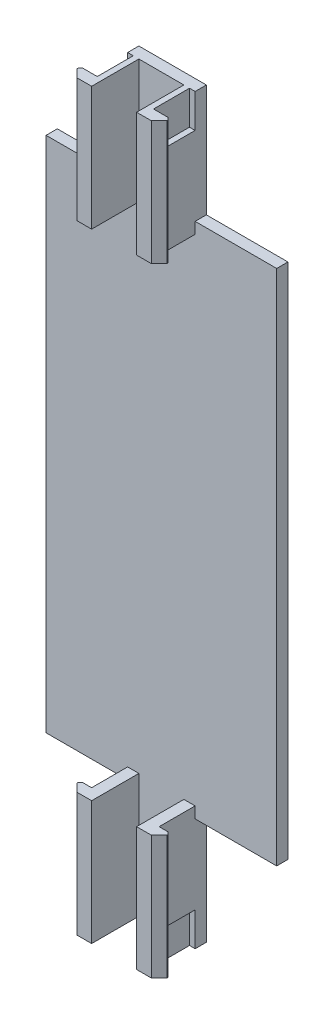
ISO-10303-21;
HEADER;
FILE_DESCRIPTION(('STEP AP214'),'2;1');
FILE_NAME('part.step','',(''),(''),'','','');
FILE_SCHEMA(('AUTOMOTIVE_DESIGN { 1 0 10303 214 1 1 1 1 }'));
ENDSEC;
DATA;
#1=APPLICATION_CONTEXT('core data for automotive mechanical design processes');
#2=APPLICATION_PROTOCOL_DEFINITION('international standard','automotive_design',2000,#1);
#3=PRODUCT_CONTEXT('',#1,'mechanical');
#4=PRODUCT('Part','Part','',(#3));
#5=PRODUCT_RELATED_PRODUCT_CATEGORY('part','',(#4));
#6=PRODUCT_DEFINITION_FORMATION('','',#4);
#7=PRODUCT_DEFINITION_CONTEXT('part definition',#1,'design');
#8=PRODUCT_DEFINITION('design','',#6,#7);
#9=PRODUCT_DEFINITION_SHAPE('','',#8);
#10=(LENGTH_UNIT() NAMED_UNIT(*) SI_UNIT(.MILLI.,.METRE.));
#11=(NAMED_UNIT(*) PLANE_ANGLE_UNIT() SI_UNIT($,.RADIAN.));
#12=(NAMED_UNIT(*) SI_UNIT($,.STERADIAN.) SOLID_ANGLE_UNIT());
#13=UNCERTAINTY_MEASURE_WITH_UNIT(LENGTH_MEASURE(1.E-05),#10,'distance_accuracy_value','');
#14=(GEOMETRIC_REPRESENTATION_CONTEXT(3) GLOBAL_UNCERTAINTY_ASSIGNED_CONTEXT((#13)) GLOBAL_UNIT_ASSIGNED_CONTEXT((#10,
#11,#12)) REPRESENTATION_CONTEXT('',''));
#15=CARTESIAN_POINT('',(0.,0.,0.));
#16=DIRECTION('',(0.,0.,1.));
#17=DIRECTION('',(1.,0.,0.));
#18=AXIS2_PLACEMENT_3D('',#15,#16,#17);
#19=CARTESIAN_POINT('',(0.,0.,1.));
#20=DIRECTION('',(0.,0.,-1.));
#21=DIRECTION('',(-1.,0.,0.));
#22=AXIS2_PLACEMENT_3D('',#19,#20,#21);
#23=PLANE('',#22);
#24=DIRECTION('',(0.,-1.,0.));
#25=VECTOR('',#24,1.);
#26=CARTESIAN_POINT('',(7.24999999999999,1.,1.));
#27=LINE('',#26,#25);
#28=CARTESIAN_POINT('',(7.24999999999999,1.,1.));
#29=VERTEX_POINT('',#28);
#30=CARTESIAN_POINT('',(7.24999999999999,0.,1.));
#31=VERTEX_POINT('',#30);
#32=EDGE_CURVE('E73',#29,#31,#27,.T.);
#33=ORIENTED_EDGE('',*,*,#32,.F.);
#34=DIRECTION('',(-1.,0.,0.));
#35=VECTOR('',#34,1.);
#36=CARTESIAN_POINT('',(0.,1.,1.));
#37=LINE('',#36,#35);
#38=CARTESIAN_POINT('',(8.24999999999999,1.,1.));
#39=VERTEX_POINT('',#38);
#40=EDGE_CURVE('E409',#39,#29,#37,.T.);
#41=ORIENTED_EDGE('',*,*,#40,.F.);
#42=DIRECTION('',(0.,-1.,0.));
#43=VECTOR('',#42,1.);
#44=CARTESIAN_POINT('',(8.24999999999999,0.,1.));
#45=LINE('',#44,#43);
#46=CARTESIAN_POINT('',(8.24999999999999,-10.,1.));
#47=VERTEX_POINT('',#46);
#48=EDGE_CURVE('E66',#39,#47,#45,.T.);
#49=ORIENTED_EDGE('',*,*,#48,.T.);
#50=DIRECTION('',(1.,0.,0.));
#51=VECTOR('',#50,1.);
#52=CARTESIAN_POINT('',(7.25,-10.,1.));
#53=LINE('',#52,#51);
#54=CARTESIAN_POINT('',(12.25,-10.,1.));
#55=VERTEX_POINT('',#54);
#56=EDGE_CURVE('E577',#47,#55,#53,.T.);
#57=ORIENTED_EDGE('',*,*,#56,.T.);
#58=DIRECTION('',(0.,-1.,0.));
#59=VECTOR('',#58,1.);
#60=CARTESIAN_POINT('',(12.25,0.,1.));
#61=LINE('',#60,#59);
#62=CARTESIAN_POINT('',(12.25,1.,1.));
#63=VERTEX_POINT('',#62);
#64=EDGE_CURVE('E566',#63,#55,#61,.T.);
#65=ORIENTED_EDGE('',*,*,#64,.F.);
#66=DIRECTION('',(-1.,0.,0.));
#67=VECTOR('',#66,1.);
#68=CARTESIAN_POINT('',(0.,1.,1.));
#69=LINE('',#68,#67);
#70=CARTESIAN_POINT('',(13.25,1.,1.));
#71=VERTEX_POINT('',#70);
#72=EDGE_CURVE('E442',#71,#63,#69,.T.);
#73=ORIENTED_EDGE('',*,*,#72,.F.);
#74=DIRECTION('',(0.,-1.,0.));
#75=VECTOR('',#74,1.);
#76=CARTESIAN_POINT('',(13.25,1.,1.));
#77=LINE('',#76,#75);
#78=CARTESIAN_POINT('',(13.25,0.,1.));
#79=VERTEX_POINT('',#78);
#80=EDGE_CURVE('E466',#71,#79,#77,.T.);
#81=ORIENTED_EDGE('',*,*,#80,.T.);
#82=DIRECTION('',(1.,0.,0.));
#83=VECTOR('',#82,1.);
#84=CARTESIAN_POINT('',(0.,0.,1.));
#85=LINE('',#84,#83);
#86=CARTESIAN_POINT('',(20.5,0.,1.));
#87=VERTEX_POINT('',#86);
#88=EDGE_CURVE('E825',#79,#87,#85,.T.);
#89=ORIENTED_EDGE('',*,*,#88,.T.);
#90=DIRECTION('',(0.,1.,0.));
#91=VECTOR('',#90,1.);
#92=CARTESIAN_POINT('',(20.5,0.,1.));
#93=LINE('',#92,#91);
#94=CARTESIAN_POINT('',(20.5,46.,1.));
#95=VERTEX_POINT('',#94);
#96=EDGE_CURVE('E830',#87,#95,#93,.T.);
#97=ORIENTED_EDGE('',*,*,#96,.T.);
#98=DIRECTION('',(-1.,0.,0.));
#99=VECTOR('',#98,1.);
#100=CARTESIAN_POINT('',(0.,46.,1.));
#101=LINE('',#100,#99);
#102=CARTESIAN_POINT('',(13.25,46.,1.));
#103=VERTEX_POINT('',#102);
#104=EDGE_CURVE('E834',#95,#103,#101,.T.);
#105=ORIENTED_EDGE('',*,*,#104,.T.);
#106=DIRECTION('',(0.,1.,0.));
#107=VECTOR('',#106,1.);
#108=CARTESIAN_POINT('',(13.25,45.,1.));
#109=LINE('',#108,#107);
#110=CARTESIAN_POINT('',(13.25,45.,1.));
#111=VERTEX_POINT('',#110);
#112=EDGE_CURVE('E703',#111,#103,#109,.T.);
#113=ORIENTED_EDGE('',*,*,#112,.F.);
#114=DIRECTION('',(-1.,0.,0.));
#115=VECTOR('',#114,1.);
#116=CARTESIAN_POINT('',(13.25,45.,1.));
#117=LINE('',#116,#115);
#118=CARTESIAN_POINT('',(12.25,45.,1.));
#119=VERTEX_POINT('',#118);
#120=EDGE_CURVE('E683',#111,#119,#117,.T.);
#121=ORIENTED_EDGE('',*,*,#120,.T.);
#122=DIRECTION('',(0.,-1.,0.));
#123=VECTOR('',#122,1.);
#124=CARTESIAN_POINT('',(12.25,56.,1.));
#125=LINE('',#124,#123);
#126=CARTESIAN_POINT('',(12.25,56.,1.));
#127=VERTEX_POINT('',#126);
#128=EDGE_CURVE('E779',#127,#119,#125,.T.);
#129=ORIENTED_EDGE('',*,*,#128,.F.);
#130=DIRECTION('',(-1.,0.,0.));
#131=VECTOR('',#130,1.);
#132=CARTESIAN_POINT('',(7.24999999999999,56.,1.));
#133=LINE('',#132,#131);
#134=CARTESIAN_POINT('',(8.24999999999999,56.,1.));
#135=VERTEX_POINT('',#134);
#136=EDGE_CURVE('E790',#127,#135,#133,.T.);
#137=ORIENTED_EDGE('',*,*,#136,.T.);
#138=DIRECTION('',(0.,-1.,0.));
#139=VECTOR('',#138,1.);
#140=CARTESIAN_POINT('',(8.24999999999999,56.,1.));
#141=LINE('',#140,#139);
#142=CARTESIAN_POINT('',(8.24999999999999,45.,1.));
#143=VERTEX_POINT('',#142);
#144=EDGE_CURVE('E755',#135,#143,#141,.T.);
#145=ORIENTED_EDGE('',*,*,#144,.T.);
#146=DIRECTION('',(1.,0.,0.));
#147=VECTOR('',#146,1.);
#148=CARTESIAN_POINT('',(7.25,45.,1.));
#149=LINE('',#148,#147);
#150=CARTESIAN_POINT('',(7.25,45.,1.));
#151=VERTEX_POINT('',#150);
#152=EDGE_CURVE('E727',#151,#143,#149,.T.);
#153=ORIENTED_EDGE('',*,*,#152,.F.);
#154=DIRECTION('',(0.,1.,0.));
#155=VECTOR('',#154,1.);
#156=CARTESIAN_POINT('',(7.25,45.,1.));
#157=LINE('',#156,#155);
#158=CARTESIAN_POINT('',(7.25,46.,1.));
#159=VERTEX_POINT('',#158);
#160=EDGE_CURVE('E739',#151,#159,#157,.T.);
#161=ORIENTED_EDGE('',*,*,#160,.T.);
#162=CARTESIAN_POINT('',(0.,46.,1.));
#163=VERTEX_POINT('',#162);
#164=EDGE_CURVE('E833',#159,#163,#101,.T.);
#165=ORIENTED_EDGE('',*,*,#164,.T.);
#166=DIRECTION('',(0.,-1.,0.));
#167=VECTOR('',#166,1.);
#168=CARTESIAN_POINT('',(0.,0.,1.));
#169=LINE('',#168,#167);
#170=CARTESIAN_POINT('',(0.,0.,1.));
#171=VERTEX_POINT('',#170);
#172=EDGE_CURVE('E821',#163,#171,#169,.T.);
#173=ORIENTED_EDGE('',*,*,#172,.T.);
#174=EDGE_CURVE('E827',#171,#31,#85,.T.);
#175=ORIENTED_EDGE('',*,*,#174,.T.);
#176=EDGE_LOOP('',(#33,#41,#49,#57,#65,#73,#81,#89,#97,#105,#113,#121,#129,#137,#145,#153,#161,
#165,#173,#175));
#177=FACE_BOUND('',#176,.T.);
#178=ADVANCED_FACE('F49',(#177),#23,.F.);
#179=CARTESIAN_POINT('',(7.25,-10.,0.));
#180=DIRECTION('',(-1.,0.,0.));
#181=DIRECTION('',(0.,-1.,0.));
#182=AXIS2_PLACEMENT_3D('',#179,#180,#181);
#183=PLANE('',#182);
#184=DIRECTION('',(0.,0.,1.));
#185=VECTOR('',#184,1.);
#186=CARTESIAN_POINT('',(7.25,-10.,0.));
#187=LINE('',#186,#185);
#188=CARTESIAN_POINT('',(7.25,-10.,0.));
#189=VERTEX_POINT('',#188);
#190=CARTESIAN_POINT('',(7.24999999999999,-10.,1.));
#191=VERTEX_POINT('',#190);
#192=EDGE_CURVE('E589',#189,#191,#187,.T.);
#193=ORIENTED_EDGE('',*,*,#192,.T.);
#194=DIRECTION('',(0.,1.,0.));
#195=VECTOR('',#194,1.);
#196=CARTESIAN_POINT('',(7.24999999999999,-10.,1.));
#197=LINE('',#196,#195);
#198=CARTESIAN_POINT('',(7.24999999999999,-7.,1.));
#199=VERTEX_POINT('',#198);
#200=EDGE_CURVE('E494',#191,#199,#197,.T.);
#201=ORIENTED_EDGE('',*,*,#200,.T.);
#202=DIRECTION('',(0.,0.,-1.));
#203=VECTOR('',#202,1.);
#204=CARTESIAN_POINT('',(7.24999999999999,-7.,1.));
#205=LINE('',#204,#203);
#206=CARTESIAN_POINT('',(7.24999999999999,-7.,4.2));
#207=VERTEX_POINT('',#206);
#208=EDGE_CURVE('E390',#207,#199,#205,.T.);
#209=ORIENTED_EDGE('',*,*,#208,.F.);
#210=DIRECTION('',(0.,1.,0.));
#211=VECTOR('',#210,1.);
#212=CARTESIAN_POINT('',(7.24999999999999,0.,4.2));
#213=LINE('',#212,#211);
#214=CARTESIAN_POINT('',(7.24999999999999,1.,4.2));
#215=VERTEX_POINT('',#214);
#216=EDGE_CURVE('E383',#207,#215,#213,.T.);
#217=ORIENTED_EDGE('',*,*,#216,.T.);
#218=DIRECTION('',(0.,0.,1.));
#219=VECTOR('',#218,1.);
#220=CARTESIAN_POINT('',(7.24999999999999,1.,0.));
#221=LINE('',#220,#219);
#222=EDGE_CURVE('E388',#29,#215,#221,.T.);
#223=ORIENTED_EDGE('',*,*,#222,.F.);
#224=ORIENTED_EDGE('',*,*,#32,.T.);
#225=DIRECTION('',(0.,0.,1.));
#226=VECTOR('',#225,1.);
#227=CARTESIAN_POINT('',(7.24999999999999,0.,0.));
#228=LINE('',#227,#226);
#229=CARTESIAN_POINT('',(7.24999999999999,0.,0.));
#230=VERTEX_POINT('',#229);
#231=EDGE_CURVE('E592',#230,#31,#228,.T.);
#232=ORIENTED_EDGE('',*,*,#231,.F.);
#233=DIRECTION('',(0.,-1.,0.));
#234=VECTOR('',#233,1.);
#235=CARTESIAN_POINT('',(7.25,-10.,0.));
#236=LINE('',#235,#234);
#237=EDGE_CURVE('E578',#230,#189,#236,.T.);
#238=ORIENTED_EDGE('',*,*,#237,.T.);
#239=EDGE_LOOP('',(#193,#201,#209,#217,#223,#224,#232,#238));
#240=FACE_BOUND('',#239,.T.);
#241=ADVANCED_FACE('F386',(#240),#183,.T.);
#242=CARTESIAN_POINT('',(7.25,-10.,0.));
#243=DIRECTION('',(0.,-1.,0.));
#244=DIRECTION('',(0.,0.,-1.));
#245=AXIS2_PLACEMENT_3D('',#242,#243,#244);
#246=PLANE('',#245);
#247=DIRECTION('',(-1.,0.,0.));
#248=VECTOR('',#247,1.);
#249=CARTESIAN_POINT('',(6.24999999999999,-10.,4.2));
#250=LINE('',#249,#248);
#251=CARTESIAN_POINT('',(7.74999999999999,-10.,4.2));
#252=VERTEX_POINT('',#251);
#253=CARTESIAN_POINT('',(6.44999999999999,-10.,4.2));
#254=VERTEX_POINT('',#253);
#255=EDGE_CURVE('E526',#252,#254,#250,.T.);
#256=ORIENTED_EDGE('',*,*,#255,.F.);
#257=DIRECTION('',(0.,0.,1.));
#258=VECTOR('',#257,1.);
#259=CARTESIAN_POINT('',(7.74999999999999,-10.,1.));
#260=LINE('',#259,#258);
#261=CARTESIAN_POINT('',(7.74999999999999,-10.,1.));
#262=VERTEX_POINT('',#261);
#263=EDGE_CURVE('E470',#262,#252,#260,.T.);
#264=ORIENTED_EDGE('',*,*,#263,.F.);
#265=DIRECTION('',(1.,0.,0.));
#266=VECTOR('',#265,1.);
#267=CARTESIAN_POINT('',(7.74999999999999,-10.,1.));
#268=LINE('',#267,#266);
#269=EDGE_CURVE('E474',#191,#262,#268,.T.);
#270=ORIENTED_EDGE('',*,*,#269,.F.);
#271=ORIENTED_EDGE('',*,*,#192,.F.);
#272=DIRECTION('',(1.,0.,0.));
#273=VECTOR('',#272,1.);
#274=CARTESIAN_POINT('',(7.25,-10.,0.));
#275=LINE('',#274,#273);
#276=CARTESIAN_POINT('',(13.25,-10.,0.));
#277=VERTEX_POINT('',#276);
#278=EDGE_CURVE('E582',#189,#277,#275,.T.);
#279=ORIENTED_EDGE('',*,*,#278,.T.);
#280=DIRECTION('',(0.,0.,1.));
#281=VECTOR('',#280,1.);
#282=CARTESIAN_POINT('',(13.25,-10.,0.));
#283=LINE('',#282,#281);
#284=CARTESIAN_POINT('',(13.25,-10.,1.));
#285=VERTEX_POINT('',#284);
#286=EDGE_CURVE('E600',#277,#285,#283,.T.);
#287=ORIENTED_EDGE('',*,*,#286,.T.);
#288=DIRECTION('',(-1.,0.,0.));
#289=VECTOR('',#288,1.);
#290=CARTESIAN_POINT('',(12.75,-10.,1.));
#291=LINE('',#290,#289);
#292=CARTESIAN_POINT('',(12.75,-10.,1.));
#293=VERTEX_POINT('',#292);
#294=EDGE_CURVE('E504',#285,#293,#291,.T.);
#295=ORIENTED_EDGE('',*,*,#294,.T.);
#296=DIRECTION('',(0.,0.,1.));
#297=VECTOR('',#296,1.);
#298=CARTESIAN_POINT('',(12.75,-10.,1.));
#299=LINE('',#298,#297);
#300=CARTESIAN_POINT('',(12.75,-10.,4.2));
#301=VERTEX_POINT('',#300);
#302=EDGE_CURVE('E500',#293,#301,#299,.T.);
#303=ORIENTED_EDGE('',*,*,#302,.T.);
#304=DIRECTION('',(1.,0.,0.));
#305=VECTOR('',#304,1.);
#306=CARTESIAN_POINT('',(14.25,-10.,4.2));
#307=LINE('',#306,#305);
#308=CARTESIAN_POINT('',(14.05,-10.,4.2));
#309=VERTEX_POINT('',#308);
#310=EDGE_CURVE('E550',#301,#309,#307,.T.);
#311=ORIENTED_EDGE('',*,*,#310,.T.);
#312=DIRECTION('',(0.707106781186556,0.,0.70710678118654));
#313=VECTOR('',#312,1.);
#314=CARTESIAN_POINT('',(8.54999999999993,-10.,-1.29999999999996));
#315=LINE('',#314,#313);
#316=CARTESIAN_POINT('',(14.25,-10.,4.39999999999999));
#317=VERTEX_POINT('',#316);
#318=EDGE_CURVE('E923',#309,#317,#315,.T.);
#319=ORIENTED_EDGE('',*,*,#318,.T.);
#320=DIRECTION('',(0.,0.,-1.));
#321=VECTOR('',#320,1.);
#322=CARTESIAN_POINT('',(14.25,-10.,5.2));
#323=LINE('',#322,#321);
#324=CARTESIAN_POINT('',(14.25,-10.,4.49999999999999));
#325=VERTEX_POINT('',#324);
#326=EDGE_CURVE('E559',#325,#317,#323,.T.);
#327=ORIENTED_EDGE('',*,*,#326,.F.);
#328=DIRECTION('',(0.707106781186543,0.,-0.707106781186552));
#329=VECTOR('',#328,1.);
#330=CARTESIAN_POINT('',(13.,-10.,5.74999999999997));
#331=LINE('',#330,#329);
#332=CARTESIAN_POINT('',(13.55,-10.,5.2));
#333=VERTEX_POINT('',#332);
#334=EDGE_CURVE('E914',#325,#333,#331,.F.);
#335=ORIENTED_EDGE('',*,*,#334,.T.);
#336=DIRECTION('',(1.,0.,0.));
#337=VECTOR('',#336,1.);
#338=CARTESIAN_POINT('',(14.25,-10.,5.2));
#339=LINE('',#338,#337);
#340=CARTESIAN_POINT('',(12.25,-10.,5.2));
#341=VERTEX_POINT('',#340);
#342=EDGE_CURVE('E555',#341,#333,#339,.T.);
#343=ORIENTED_EDGE('',*,*,#342,.F.);
#344=DIRECTION('',(0.,0.,-1.));
#345=VECTOR('',#344,1.);
#346=CARTESIAN_POINT('',(12.25,-10.,4.2));
#347=LINE('',#346,#345);
#348=EDGE_CURVE('E570',#341,#55,#347,.T.);
#349=ORIENTED_EDGE('',*,*,#348,.T.);
#350=ORIENTED_EDGE('',*,*,#56,.F.);
#351=DIRECTION('',(0.,0.,-1.));
#352=VECTOR('',#351,1.);
#353=CARTESIAN_POINT('',(8.24999999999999,-10.,4.2));
#354=LINE('',#353,#352);
#355=CARTESIAN_POINT('',(8.24999999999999,-10.,5.2));
#356=VERTEX_POINT('',#355);
#357=EDGE_CURVE('E393',#356,#47,#354,.T.);
#358=ORIENTED_EDGE('',*,*,#357,.F.);
#359=DIRECTION('',(-1.,0.,0.));
#360=VECTOR('',#359,1.);
#361=CARTESIAN_POINT('',(6.24999999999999,-10.,5.2));
#362=LINE('',#361,#360);
#363=CARTESIAN_POINT('',(6.95,-10.,5.2));
#364=VERTEX_POINT('',#363);
#365=EDGE_CURVE('E532',#356,#364,#362,.T.);
#366=ORIENTED_EDGE('',*,*,#365,.T.);
#367=DIRECTION('',(-0.70710678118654,0.,-0.707106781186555));
#368=VECTOR('',#367,1.);
#369=CARTESIAN_POINT('',(4.5,-10.,2.74999999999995));
#370=LINE('',#369,#368);
#371=CARTESIAN_POINT('',(6.24999999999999,-10.,4.49999999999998));
#372=VERTEX_POINT('',#371);
#373=EDGE_CURVE('E932',#364,#372,#370,.T.);
#374=ORIENTED_EDGE('',*,*,#373,.T.);
#375=DIRECTION('',(0.,0.,-1.));
#376=VECTOR('',#375,1.);
#377=CARTESIAN_POINT('',(6.24999999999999,-10.,5.2));
#378=LINE('',#377,#376);
#379=CARTESIAN_POINT('',(6.24999999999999,-10.,4.39999999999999));
#380=VERTEX_POINT('',#379);
#381=EDGE_CURVE('E540',#372,#380,#378,.T.);
#382=ORIENTED_EDGE('',*,*,#381,.T.);
#383=DIRECTION('',(-0.707106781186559,0.,0.707106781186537));
#384=VECTOR('',#383,1.);
#385=CARTESIAN_POINT('',(8.95000000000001,-10.,1.70000000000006));
#386=LINE('',#385,#384);
#387=EDGE_CURVE('E11',#380,#254,#386,.F.);
#388=ORIENTED_EDGE('',*,*,#387,.T.);
#389=EDGE_LOOP('',(#256,#264,#270,#271,#279,#287,#295,#303,#311,#319,#327,#335,#343,#349,#350,
#358,#366,#374,#382,#388));
#390=FACE_BOUND('',#389,.T.);
#391=ADVANCED_FACE('F945',(#390),#246,.T.);
#392=CARTESIAN_POINT('',(0.,0.,1.));
#393=DIRECTION('',(0.,1.,0.));
#394=DIRECTION('',(0.,0.,1.));
#395=AXIS2_PLACEMENT_3D('',#392,#393,#394);
#396=PLANE('',#395);
#397=DIRECTION('',(0.,0.,1.));
#398=VECTOR('',#397,1.);
#399=CARTESIAN_POINT('',(13.25,0.,0.));
#400=LINE('',#399,#398);
#401=CARTESIAN_POINT('',(13.25,0.,0.));
#402=VERTEX_POINT('',#401);
#403=EDGE_CURVE('E596',#402,#79,#400,.T.);
#404=ORIENTED_EDGE('',*,*,#403,.F.);
#405=DIRECTION('',(1.,0.,0.));
#406=VECTOR('',#405,1.);
#407=CARTESIAN_POINT('',(0.,0.,0.));
#408=LINE('',#407,#406);
#409=CARTESIAN_POINT('',(20.5,0.,0.));
#410=VERTEX_POINT('',#409);
#411=EDGE_CURVE('E841',#402,#410,#408,.T.);
#412=ORIENTED_EDGE('',*,*,#411,.T.);
#413=DIRECTION('',(0.,0.,-1.));
#414=VECTOR('',#413,1.);
#415=CARTESIAN_POINT('',(20.5,0.,1.));
#416=LINE('',#415,#414);
#417=EDGE_CURVE('E860',#87,#410,#416,.T.);
#418=ORIENTED_EDGE('',*,*,#417,.F.);
#419=ORIENTED_EDGE('',*,*,#88,.F.);
#420=EDGE_LOOP('',(#404,#412,#418,#419));
#421=FACE_BOUND('',#420,.T.);
#422=ADVANCED_FACE('F996',(#421),#396,.F.);
#423=CARTESIAN_POINT('',(7.25,46.,0.));
#424=DIRECTION('',(-1.,0.,0.));
#425=DIRECTION('',(0.,-1.,0.));
#426=AXIS2_PLACEMENT_3D('',#423,#424,#425);
#427=PLANE('',#426);
#428=DIRECTION('',(0.,0.,-1.));
#429=VECTOR('',#428,1.);
#430=CARTESIAN_POINT('',(7.24999999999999,53.,1.));
#431=LINE('',#430,#429);
#432=CARTESIAN_POINT('',(7.24999999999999,53.,4.2));
#433=VERTEX_POINT('',#432);
#434=CARTESIAN_POINT('',(7.24999999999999,53.,1.));
#435=VERTEX_POINT('',#434);
#436=EDGE_CURVE('E614',#433,#435,#431,.T.);
#437=ORIENTED_EDGE('',*,*,#436,.T.);
#438=DIRECTION('',(0.,1.,0.));
#439=VECTOR('',#438,1.);
#440=CARTESIAN_POINT('',(7.24999999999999,53.,1.));
#441=LINE('',#440,#439);
#442=CARTESIAN_POINT('',(7.24999999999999,56.,1.));
#443=VERTEX_POINT('',#442);
#444=EDGE_CURVE('E634',#435,#443,#441,.T.);
#445=ORIENTED_EDGE('',*,*,#444,.T.);
#446=DIRECTION('',(0.,0.,1.));
#447=VECTOR('',#446,1.);
#448=CARTESIAN_POINT('',(7.24999999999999,56.,0.));
#449=LINE('',#448,#447);
#450=CARTESIAN_POINT('',(7.24999999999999,56.,0.));
#451=VERTEX_POINT('',#450);
#452=EDGE_CURVE('E805',#451,#443,#449,.T.);
#453=ORIENTED_EDGE('',*,*,#452,.F.);
#454=DIRECTION('',(0.,-1.,0.));
#455=VECTOR('',#454,1.);
#456=CARTESIAN_POINT('',(7.25,46.,0.));
#457=LINE('',#456,#455);
#458=CARTESIAN_POINT('',(7.25,46.,0.));
#459=VERTEX_POINT('',#458);
#460=EDGE_CURVE('E791',#451,#459,#457,.T.);
#461=ORIENTED_EDGE('',*,*,#460,.T.);
#462=DIRECTION('',(0.,0.,1.));
#463=VECTOR('',#462,1.);
#464=CARTESIAN_POINT('',(7.25,46.,0.));
#465=LINE('',#464,#463);
#466=EDGE_CURVE('E802',#459,#159,#465,.T.);
#467=ORIENTED_EDGE('',*,*,#466,.T.);
#468=ORIENTED_EDGE('',*,*,#160,.F.);
#469=DIRECTION('',(0.,0.,-1.));
#470=VECTOR('',#469,1.);
#471=CARTESIAN_POINT('',(7.24999999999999,45.,4.2));
#472=LINE('',#471,#470);
#473=CARTESIAN_POINT('',(7.24999999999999,45.,4.2));
#474=VERTEX_POINT('',#473);
#475=EDGE_CURVE('E723',#474,#151,#472,.T.);
#476=ORIENTED_EDGE('',*,*,#475,.F.);
#477=DIRECTION('',(0.,1.,0.));
#478=VECTOR('',#477,1.);
#479=CARTESIAN_POINT('',(7.24999999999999,56.,4.2));
#480=LINE('',#479,#478);
#481=EDGE_CURVE('E756',#474,#433,#480,.T.);
#482=ORIENTED_EDGE('',*,*,#481,.T.);
#483=EDGE_LOOP('',(#437,#445,#453,#461,#467,#468,#476,#482));
#484=FACE_BOUND('',#483,.T.);
#485=ADVANCED_FACE('F975',(#484),#427,.T.);
#486=CARTESIAN_POINT('',(7.24999999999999,56.,0.));
#487=DIRECTION('',(0.,1.,0.));
#488=DIRECTION('',(0.,0.,1.));
#489=AXIS2_PLACEMENT_3D('',#486,#487,#488);
#490=PLANE('',#489);
#491=DIRECTION('',(0.,0.,1.));
#492=VECTOR('',#491,1.);
#493=CARTESIAN_POINT('',(7.74999999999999,56.,1.));
#494=LINE('',#493,#492);
#495=CARTESIAN_POINT('',(7.74999999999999,56.,1.));
#496=VERTEX_POINT('',#495);
#497=CARTESIAN_POINT('',(7.74999999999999,56.,4.2));
#498=VERTEX_POINT('',#497);
#499=EDGE_CURVE('E595',#496,#498,#494,.T.);
#500=ORIENTED_EDGE('',*,*,#499,.T.);
#501=DIRECTION('',(1.,0.,0.));
#502=VECTOR('',#501,1.);
#503=CARTESIAN_POINT('',(6.24999999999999,56.,4.2));
#504=LINE('',#503,#502);
#505=CARTESIAN_POINT('',(6.45,56.,4.2));
#506=VERTEX_POINT('',#505);
#507=EDGE_CURVE('E742',#506,#498,#504,.T.);
#508=ORIENTED_EDGE('',*,*,#507,.F.);
#509=DIRECTION('',(0.707106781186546,0.,-0.707106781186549));
#510=VECTOR('',#509,1.);
#511=CARTESIAN_POINT('',(8.94999999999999,56.,1.7));
#512=LINE('',#511,#510);
#513=CARTESIAN_POINT('',(6.24999999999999,56.,4.40000000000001));
#514=VERTEX_POINT('',#513);
#515=EDGE_CURVE('E902',#506,#514,#512,.F.);
#516=ORIENTED_EDGE('',*,*,#515,.T.);
#517=DIRECTION('',(0.,0.,-1.));
#518=VECTOR('',#517,1.);
#519=CARTESIAN_POINT('',(6.24999999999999,56.,5.2));
#520=LINE('',#519,#518);
#521=CARTESIAN_POINT('',(6.24999999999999,56.,4.49999999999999));
#522=VERTEX_POINT('',#521);
#523=EDGE_CURVE('E749',#522,#514,#520,.T.);
#524=ORIENTED_EDGE('',*,*,#523,.F.);
#525=DIRECTION('',(0.707106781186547,0.,0.707106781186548));
#526=VECTOR('',#525,1.);
#527=CARTESIAN_POINT('',(4.5,56.,2.74999999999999));
#528=LINE('',#527,#526);
#529=CARTESIAN_POINT('',(6.95,56.,5.2));
#530=VERTEX_POINT('',#529);
#531=EDGE_CURVE('E892',#522,#530,#528,.T.);
#532=ORIENTED_EDGE('',*,*,#531,.T.);
#533=DIRECTION('',(1.,0.,0.));
#534=VECTOR('',#533,1.);
#535=CARTESIAN_POINT('',(6.24999999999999,56.,5.2));
#536=LINE('',#535,#534);
#537=CARTESIAN_POINT('',(8.24999999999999,56.,5.2));
#538=VERTEX_POINT('',#537);
#539=EDGE_CURVE('E746',#530,#538,#536,.T.);
#540=ORIENTED_EDGE('',*,*,#539,.T.);
#541=DIRECTION('',(0.,0.,-1.));
#542=VECTOR('',#541,1.);
#543=CARTESIAN_POINT('',(8.24999999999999,56.,4.2));
#544=LINE('',#543,#542);
#545=EDGE_CURVE('E760',#538,#135,#544,.T.);
#546=ORIENTED_EDGE('',*,*,#545,.T.);
#547=ORIENTED_EDGE('',*,*,#136,.F.);
#548=DIRECTION('',(0.,0.,-1.));
#549=VECTOR('',#548,1.);
#550=CARTESIAN_POINT('',(12.25,56.,4.2));
#551=LINE('',#550,#549);
#552=CARTESIAN_POINT('',(12.25,56.,5.2));
#553=VERTEX_POINT('',#552);
#554=EDGE_CURVE('E784',#553,#127,#551,.T.);
#555=ORIENTED_EDGE('',*,*,#554,.F.);
#556=DIRECTION('',(-1.,0.,0.));
#557=VECTOR('',#556,1.);
#558=CARTESIAN_POINT('',(14.25,56.,5.2));
#559=LINE('',#558,#557);
#560=CARTESIAN_POINT('',(13.55,56.,5.2));
#561=VERTEX_POINT('',#560);
#562=EDGE_CURVE('E767',#561,#553,#559,.T.);
#563=ORIENTED_EDGE('',*,*,#562,.F.);
#564=DIRECTION('',(-0.707106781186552,0.,0.707106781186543));
#565=VECTOR('',#564,1.);
#566=CARTESIAN_POINT('',(13.,56.,5.75000000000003));
#567=LINE('',#566,#565);
#568=CARTESIAN_POINT('',(14.25,56.,4.5));
#569=VERTEX_POINT('',#568);
#570=EDGE_CURVE('E872',#561,#569,#567,.F.);
#571=ORIENTED_EDGE('',*,*,#570,.T.);
#572=DIRECTION('',(0.,0.,-1.));
#573=VECTOR('',#572,1.);
#574=CARTESIAN_POINT('',(14.25,56.,5.2));
#575=LINE('',#574,#573);
#576=CARTESIAN_POINT('',(14.25,56.,4.40000000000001));
#577=VERTEX_POINT('',#576);
#578=EDGE_CURVE('E773',#569,#577,#575,.T.);
#579=ORIENTED_EDGE('',*,*,#578,.T.);
#580=DIRECTION('',(-0.707106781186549,0.,-0.707106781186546));
#581=VECTOR('',#580,1.);
#582=CARTESIAN_POINT('',(8.54999999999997,56.,-1.29999999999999));
#583=LINE('',#582,#581);
#584=CARTESIAN_POINT('',(14.05,56.,4.2));
#585=VERTEX_POINT('',#584);
#586=EDGE_CURVE('E882',#577,#585,#583,.T.);
#587=ORIENTED_EDGE('',*,*,#586,.T.);
#588=DIRECTION('',(-1.,0.,0.));
#589=VECTOR('',#588,1.);
#590=CARTESIAN_POINT('',(14.25,56.,4.2));
#591=LINE('',#590,#589);
#592=CARTESIAN_POINT('',(12.75,56.,4.2));
#593=VERTEX_POINT('',#592);
#594=EDGE_CURVE('E766',#585,#593,#591,.T.);
#595=ORIENTED_EDGE('',*,*,#594,.T.);
#596=DIRECTION('',(0.,0.,1.));
#597=VECTOR('',#596,1.);
#598=CARTESIAN_POINT('',(12.75,56.,1.));
#599=LINE('',#598,#597);
#600=CARTESIAN_POINT('',(12.75,56.,1.));
#601=VERTEX_POINT('',#600);
#602=EDGE_CURVE('E633',#601,#593,#599,.T.);
#603=ORIENTED_EDGE('',*,*,#602,.F.);
#604=DIRECTION('',(-1.,0.,0.));
#605=VECTOR('',#604,1.);
#606=CARTESIAN_POINT('',(12.75,56.,1.));
#607=LINE('',#606,#605);
#608=CARTESIAN_POINT('',(13.25,56.,1.));
#609=VERTEX_POINT('',#608);
#610=EDGE_CURVE('E645',#609,#601,#607,.T.);
#611=ORIENTED_EDGE('',*,*,#610,.F.);
#612=DIRECTION('',(0.,0.,1.));
#613=VECTOR('',#612,1.);
#614=CARTESIAN_POINT('',(13.25,56.,0.));
#615=LINE('',#614,#613);
#616=CARTESIAN_POINT('',(13.25,56.,0.));
#617=VERTEX_POINT('',#616);
#618=EDGE_CURVE('E810',#617,#609,#615,.T.);
#619=ORIENTED_EDGE('',*,*,#618,.F.);
#620=DIRECTION('',(-1.,0.,0.));
#621=VECTOR('',#620,1.);
#622=CARTESIAN_POINT('',(7.24999999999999,56.,0.));
#623=LINE('',#622,#621);
#624=EDGE_CURVE('E798',#617,#451,#623,.T.);
#625=ORIENTED_EDGE('',*,*,#624,.T.);
#626=ORIENTED_EDGE('',*,*,#452,.T.);
#627=DIRECTION('',(1.,0.,0.));
#628=VECTOR('',#627,1.);
#629=CARTESIAN_POINT('',(7.74999999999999,56.,1.));
#630=LINE('',#629,#628);
#631=EDGE_CURVE('E611',#443,#496,#630,.T.);
#632=ORIENTED_EDGE('',*,*,#631,.T.);
#633=EDGE_LOOP('',(#500,#508,#516,#524,#532,#540,#546,#547,#555,#563,#571,#579,#587,#595,#603,
#611,#619,#625,#626,#632));
#634=FACE_BOUND('',#633,.T.);
#635=ADVANCED_FACE('F1410',(#634),#490,.T.);
#636=CARTESIAN_POINT('',(0.,46.,1.));
#637=DIRECTION('',(0.,-1.,0.));
#638=DIRECTION('',(0.,0.,-1.));
#639=AXIS2_PLACEMENT_3D('',#636,#637,#638);
#640=PLANE('',#639);
#641=ORIENTED_EDGE('',*,*,#466,.F.);
#642=DIRECTION('',(-1.,0.,0.));
#643=VECTOR('',#642,1.);
#644=CARTESIAN_POINT('',(0.,46.,0.));
#645=LINE('',#644,#643);
#646=CARTESIAN_POINT('',(0.,46.,0.));
#647=VERTEX_POINT('',#646);
#648=EDGE_CURVE('E849',#459,#647,#645,.T.);
#649=ORIENTED_EDGE('',*,*,#648,.T.);
#650=DIRECTION('',(0.,0.,-1.));
#651=VECTOR('',#650,1.);
#652=CARTESIAN_POINT('',(0.,46.,1.));
#653=LINE('',#652,#651);
#654=EDGE_CURVE('E837',#163,#647,#653,.T.);
#655=ORIENTED_EDGE('',*,*,#654,.F.);
#656=ORIENTED_EDGE('',*,*,#164,.F.);
#657=EDGE_LOOP('',(#641,#649,#655,#656));
#658=FACE_BOUND('',#657,.T.);
#659=ADVANCED_FACE('F987',(#658),#640,.F.);
#660=CARTESIAN_POINT('',(0.,0.,1.));
#661=DIRECTION('',(1.,0.,0.));
#662=DIRECTION('',(0.,0.,-1.));
#663=AXIS2_PLACEMENT_3D('',#660,#661,#662);
#664=PLANE('',#663);
#665=DIRECTION('',(0.,-1.,0.));
#666=VECTOR('',#665,1.);
#667=CARTESIAN_POINT('',(0.,0.,0.));
#668=LINE('',#667,#666);
#669=CARTESIAN_POINT('',(0.,0.,0.));
#670=VERTEX_POINT('',#669);
#671=EDGE_CURVE('E809',#647,#670,#668,.T.);
#672=ORIENTED_EDGE('',*,*,#671,.T.);
#673=DIRECTION('',(0.,0.,-1.));
#674=VECTOR('',#673,1.);
#675=CARTESIAN_POINT('',(0.,0.,1.));
#676=LINE('',#675,#674);
#677=EDGE_CURVE('E864',#171,#670,#676,.T.);
#678=ORIENTED_EDGE('',*,*,#677,.F.);
#679=ORIENTED_EDGE('',*,*,#172,.F.);
#680=ORIENTED_EDGE('',*,*,#654,.T.);
#681=EDGE_LOOP('',(#672,#678,#679,#680));
#682=FACE_BOUND('',#681,.T.);
#683=ADVANCED_FACE('F994',(#682),#664,.F.);
#684=EDGE_CURVE('E842',#670,#230,#408,.T.);
#685=ORIENTED_EDGE('',*,*,#684,.T.);
#686=ORIENTED_EDGE('',*,*,#231,.T.);
#687=ORIENTED_EDGE('',*,*,#174,.F.);
#688=ORIENTED_EDGE('',*,*,#677,.T.);
#689=EDGE_LOOP('',(#685,#686,#687,#688));
#690=FACE_BOUND('',#689,.T.);
#691=ADVANCED_FACE('F990',(#690),#396,.F.);
#692=CARTESIAN_POINT('',(20.5,0.,1.));
#693=DIRECTION('',(-1.,0.,0.));
#694=DIRECTION('',(0.,0.,1.));
#695=AXIS2_PLACEMENT_3D('',#692,#693,#694);
#696=PLANE('',#695);
#697=DIRECTION('',(0.,1.,0.));
#698=VECTOR('',#697,1.);
#699=CARTESIAN_POINT('',(20.5,0.,0.));
#700=LINE('',#699,#698);
#701=CARTESIAN_POINT('',(20.5,46.,0.));
#702=VERTEX_POINT('',#701);
#703=EDGE_CURVE('E846',#410,#702,#700,.T.);
#704=ORIENTED_EDGE('',*,*,#703,.T.);
#705=DIRECTION('',(0.,0.,-1.));
#706=VECTOR('',#705,1.);
#707=CARTESIAN_POINT('',(20.5,46.,1.));
#708=LINE('',#707,#706);
#709=EDGE_CURVE('E856',#95,#702,#708,.T.);
#710=ORIENTED_EDGE('',*,*,#709,.F.);
#711=ORIENTED_EDGE('',*,*,#96,.F.);
#712=ORIENTED_EDGE('',*,*,#417,.T.);
#713=EDGE_LOOP('',(#704,#710,#711,#712));
#714=FACE_BOUND('',#713,.T.);
#715=ADVANCED_FACE('F985',(#714),#696,.F.);
#716=CARTESIAN_POINT('',(13.25,46.,0.));
#717=VERTEX_POINT('',#716);
#718=EDGE_CURVE('E826',#702,#717,#645,.T.);
#719=ORIENTED_EDGE('',*,*,#718,.T.);
#720=DIRECTION('',(0.,0.,1.));
#721=VECTOR('',#720,1.);
#722=CARTESIAN_POINT('',(13.25,46.,0.));
#723=LINE('',#722,#721);
#724=EDGE_CURVE('E814',#717,#103,#723,.T.);
#725=ORIENTED_EDGE('',*,*,#724,.T.);
#726=ORIENTED_EDGE('',*,*,#104,.F.);
#727=ORIENTED_EDGE('',*,*,#709,.T.);
#728=EDGE_LOOP('',(#719,#725,#726,#727));
#729=FACE_BOUND('',#728,.T.);
#730=ADVANCED_FACE('F981',(#729),#640,.F.);
#731=CARTESIAN_POINT('',(0.,0.,0.));
#732=DIRECTION('',(0.,0.,-1.));
#733=DIRECTION('',(-1.,0.,0.));
#734=AXIS2_PLACEMENT_3D('',#731,#732,#733);
#735=PLANE('',#734);
#736=ORIENTED_EDGE('',*,*,#671,.F.);
#737=ORIENTED_EDGE('',*,*,#648,.F.);
#738=ORIENTED_EDGE('',*,*,#460,.F.);
#739=ORIENTED_EDGE('',*,*,#624,.F.);
#740=DIRECTION('',(0.,1.,0.));
#741=VECTOR('',#740,1.);
#742=CARTESIAN_POINT('',(13.25,46.,0.));
#743=LINE('',#742,#741);
#744=EDGE_CURVE('E794',#717,#617,#743,.T.);
#745=ORIENTED_EDGE('',*,*,#744,.F.);
#746=ORIENTED_EDGE('',*,*,#718,.F.);
#747=ORIENTED_EDGE('',*,*,#703,.F.);
#748=ORIENTED_EDGE('',*,*,#411,.F.);
#749=DIRECTION('',(0.,1.,0.));
#750=VECTOR('',#749,1.);
#751=CARTESIAN_POINT('',(13.25,-10.,0.));
#752=LINE('',#751,#750);
#753=EDGE_CURVE('E586',#277,#402,#752,.T.);
#754=ORIENTED_EDGE('',*,*,#753,.F.);
#755=ORIENTED_EDGE('',*,*,#278,.F.);
#756=ORIENTED_EDGE('',*,*,#237,.F.);
#757=ORIENTED_EDGE('',*,*,#684,.F.);
#758=EDGE_LOOP('',(#736,#737,#738,#739,#745,#746,#747,#748,#754,#755,#756,#757));
#759=FACE_BOUND('',#758,.T.);
#760=ADVANCED_FACE('F977',(#759),#735,.T.);
#761=CARTESIAN_POINT('',(13.25,46.,0.));
#762=DIRECTION('',(1.,0.,0.));
#763=DIRECTION('',(0.,0.,-1.));
#764=AXIS2_PLACEMENT_3D('',#761,#762,#763);
#765=PLANE('',#764);
#766=DIRECTION('',(0.,1.,0.));
#767=VECTOR('',#766,1.);
#768=CARTESIAN_POINT('',(13.25,53.,1.));
#769=LINE('',#768,#767);
#770=CARTESIAN_POINT('',(13.25,53.,1.));
#771=VERTEX_POINT('',#770);
#772=EDGE_CURVE('E666',#771,#609,#769,.T.);
#773=ORIENTED_EDGE('',*,*,#772,.F.);
#774=DIRECTION('',(0.,0.,-1.));
#775=VECTOR('',#774,1.);
#776=CARTESIAN_POINT('',(13.25,53.,1.));
#777=LINE('',#776,#775);
#778=CARTESIAN_POINT('',(13.25,53.,4.2));
#779=VERTEX_POINT('',#778);
#780=EDGE_CURVE('E648',#779,#771,#777,.T.);
#781=ORIENTED_EDGE('',*,*,#780,.F.);
#782=DIRECTION('',(0.,1.,0.));
#783=VECTOR('',#782,1.);
#784=CARTESIAN_POINT('',(13.25,56.,4.2));
#785=LINE('',#784,#783);
#786=CARTESIAN_POINT('',(13.25,45.,4.2));
#787=VERTEX_POINT('',#786);
#788=EDGE_CURVE('E780',#787,#779,#785,.T.);
#789=ORIENTED_EDGE('',*,*,#788,.F.);
#790=DIRECTION('',(0.,0.,-1.));
#791=VECTOR('',#790,1.);
#792=CARTESIAN_POINT('',(13.25,45.,4.2));
#793=LINE('',#792,#791);
#794=EDGE_CURVE('E687',#787,#111,#793,.T.);
#795=ORIENTED_EDGE('',*,*,#794,.T.);
#796=ORIENTED_EDGE('',*,*,#112,.T.);
#797=ORIENTED_EDGE('',*,*,#724,.F.);
#798=ORIENTED_EDGE('',*,*,#744,.T.);
#799=ORIENTED_EDGE('',*,*,#618,.T.);
#800=EDGE_LOOP('',(#773,#781,#789,#795,#796,#797,#798,#799));
#801=FACE_BOUND('',#800,.T.);
#802=ADVANCED_FACE('F980',(#801),#765,.T.);
#803=CARTESIAN_POINT('',(12.25,56.,4.2));
#804=DIRECTION('',(1.,0.,0.));
#805=DIRECTION('',(0.,1.,0.));
#806=AXIS2_PLACEMENT_3D('',#803,#804,#805);
#807=PLANE('',#806);
#808=ORIENTED_EDGE('',*,*,#128,.T.);
#809=DIRECTION('',(0.,0.,1.));
#810=VECTOR('',#809,1.);
#811=CARTESIAN_POINT('',(12.25,45.,1.));
#812=LINE('',#811,#810);
#813=CARTESIAN_POINT('',(12.25,45.,5.2));
#814=VERTEX_POINT('',#813);
#815=EDGE_CURVE('E679',#119,#814,#812,.T.);
#816=ORIENTED_EDGE('',*,*,#815,.T.);
#817=DIRECTION('',(0.,-1.,0.));
#818=VECTOR('',#817,1.);
#819=CARTESIAN_POINT('',(12.25,56.,5.2));
#820=LINE('',#819,#818);
#821=EDGE_CURVE('E770',#553,#814,#820,.T.);
#822=ORIENTED_EDGE('',*,*,#821,.F.);
#823=ORIENTED_EDGE('',*,*,#554,.T.);
#824=EDGE_LOOP('',(#808,#816,#822,#823));
#825=FACE_BOUND('',#824,.T.);
#826=ADVANCED_FACE('F1567',(#825),#807,.F.);
#827=CARTESIAN_POINT('',(14.25,56.,5.2));
#828=DIRECTION('',(-1.,0.,0.));
#829=DIRECTION('',(0.,-1.,0.));
#830=AXIS2_PLACEMENT_3D('',#827,#828,#829);
#831=PLANE('',#830);
#832=DIRECTION('',(0.,-1.,0.));
#833=VECTOR('',#832,1.);
#834=CARTESIAN_POINT('',(14.25,56.,4.5));
#835=LINE('',#834,#833);
#836=CARTESIAN_POINT('',(14.25,45.,4.49999999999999));
#837=VERTEX_POINT('',#836);
#838=EDGE_CURVE('E875',#569,#837,#835,.T.);
#839=ORIENTED_EDGE('',*,*,#838,.T.);
#840=DIRECTION('',(0.,0.,-1.));
#841=VECTOR('',#840,1.);
#842=CARTESIAN_POINT('',(14.25,45.,4.49999999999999));
#843=LINE('',#842,#841);
#844=CARTESIAN_POINT('',(14.25,45.,4.40000000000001));
#845=VERTEX_POINT('',#844);
#846=EDGE_CURVE('E699',#837,#845,#843,.T.);
#847=ORIENTED_EDGE('',*,*,#846,.T.);
#848=DIRECTION('',(0.,1.,0.));
#849=VECTOR('',#848,1.);
#850=CARTESIAN_POINT('',(14.25,56.,4.40000000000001));
#851=LINE('',#850,#849);
#852=EDGE_CURVE('E878',#845,#577,#851,.T.);
#853=ORIENTED_EDGE('',*,*,#852,.T.);
#854=ORIENTED_EDGE('',*,*,#578,.F.);
#855=EDGE_LOOP('',(#839,#847,#853,#854));
#856=FACE_BOUND('',#855,.T.);
#857=ADVANCED_FACE('F1557',(#856),#831,.F.);
#858=CARTESIAN_POINT('',(0.,0.,5.2));
#859=DIRECTION('',(0.,0.,-1.));
#860=DIRECTION('',(-1.,0.,0.));
#861=AXIS2_PLACEMENT_3D('',#858,#859,#860);
#862=PLANE('',#861);
#863=ORIENTED_EDGE('',*,*,#821,.T.);
#864=DIRECTION('',(1.,0.,0.));
#865=VECTOR('',#864,1.);
#866=CARTESIAN_POINT('',(12.25,45.,5.2));
#867=LINE('',#866,#865);
#868=CARTESIAN_POINT('',(13.55,45.,5.2));
#869=VERTEX_POINT('',#868);
#870=EDGE_CURVE('E675',#814,#869,#867,.T.);
#871=ORIENTED_EDGE('',*,*,#870,.T.);
#872=DIRECTION('',(0.,1.,0.));
#873=VECTOR('',#872,1.);
#874=CARTESIAN_POINT('',(13.55,0.,5.2));
#875=LINE('',#874,#873);
#876=EDGE_CURVE('E868',#869,#561,#875,.T.);
#877=ORIENTED_EDGE('',*,*,#876,.T.);
#878=ORIENTED_EDGE('',*,*,#562,.T.);
#879=EDGE_LOOP('',(#863,#871,#877,#878));
#880=FACE_BOUND('',#879,.T.);
#881=ADVANCED_FACE('F1547',(#880),#862,.F.);
#882=CARTESIAN_POINT('',(0.,0.,4.2));
#883=DIRECTION('',(0.,0.,-1.));
#884=DIRECTION('',(-1.,0.,0.));
#885=AXIS2_PLACEMENT_3D('',#882,#883,#884);
#886=PLANE('',#885);
#887=ORIENTED_EDGE('',*,*,#594,.F.);
#888=DIRECTION('',(0.,-1.,0.));
#889=VECTOR('',#888,1.);
#890=CARTESIAN_POINT('',(14.05,46.,4.2));
#891=LINE('',#890,#889);
#892=CARTESIAN_POINT('',(14.05,45.,4.2));
#893=VERTEX_POINT('',#892);
#894=EDGE_CURVE('E885',#585,#893,#891,.T.);
#895=ORIENTED_EDGE('',*,*,#894,.T.);
#896=DIRECTION('',(-1.,0.,0.));
#897=VECTOR('',#896,1.);
#898=CARTESIAN_POINT('',(14.05,45.,4.2));
#899=LINE('',#898,#897);
#900=EDGE_CURVE('E691',#893,#787,#899,.T.);
#901=ORIENTED_EDGE('',*,*,#900,.T.);
#902=ORIENTED_EDGE('',*,*,#788,.T.);
#903=DIRECTION('',(1.,0.,0.));
#904=VECTOR('',#903,1.);
#905=CARTESIAN_POINT('',(12.75,53.,4.2));
#906=LINE('',#905,#904);
#907=CARTESIAN_POINT('',(12.75,53.,4.2));
#908=VERTEX_POINT('',#907);
#909=EDGE_CURVE('E644',#908,#779,#906,.T.);
#910=ORIENTED_EDGE('',*,*,#909,.F.);
#911=DIRECTION('',(0.,1.,0.));
#912=VECTOR('',#911,1.);
#913=CARTESIAN_POINT('',(12.75,53.,4.2));
#914=LINE('',#913,#912);
#915=EDGE_CURVE('E655',#908,#593,#914,.T.);
#916=ORIENTED_EDGE('',*,*,#915,.T.);
#917=EDGE_LOOP('',(#887,#895,#901,#902,#910,#916));
#918=FACE_BOUND('',#917,.T.);
#919=ADVANCED_FACE('F1008',(#918),#886,.T.);
#920=CARTESIAN_POINT('',(13.55,0.,5.2));
#921=DIRECTION('',(-0.707106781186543,0.,-0.707106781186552));
#922=DIRECTION('',(0.,1.,0.));
#923=AXIS2_PLACEMENT_3D('',#920,#921,#922);
#924=PLANE('',#923);
#925=ORIENTED_EDGE('',*,*,#876,.F.);
#926=DIRECTION('',(0.707106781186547,0.,-0.707106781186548));
#927=VECTOR('',#926,1.);
#928=CARTESIAN_POINT('',(13.55,45.,5.2));
#929=LINE('',#928,#927);
#930=EDGE_CURVE('E665',#869,#837,#929,.T.);
#931=ORIENTED_EDGE('',*,*,#930,.T.);
#932=ORIENTED_EDGE('',*,*,#838,.F.);
#933=ORIENTED_EDGE('',*,*,#570,.F.);
#934=EDGE_LOOP('',(#925,#931,#932,#933));
#935=FACE_BOUND('',#934,.T.);
#936=ADVANCED_FACE('F1001',(#935),#924,.F.);
#937=CARTESIAN_POINT('',(14.25,56.,4.40000000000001));
#938=DIRECTION('',(0.707106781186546,0.,-0.707106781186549));
#939=DIRECTION('',(0.,-1.,0.));
#940=AXIS2_PLACEMENT_3D('',#937,#938,#939);
#941=PLANE('',#940);
#942=ORIENTED_EDGE('',*,*,#852,.F.);
#943=DIRECTION('',(-0.707106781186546,0.,-0.707106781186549));
#944=VECTOR('',#943,1.);
#945=CARTESIAN_POINT('',(14.25,45.,4.40000000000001));
#946=LINE('',#945,#944);
#947=EDGE_CURVE('E695',#845,#893,#946,.T.);
#948=ORIENTED_EDGE('',*,*,#947,.T.);
#949=ORIENTED_EDGE('',*,*,#894,.F.);
#950=ORIENTED_EDGE('',*,*,#586,.F.);
#951=EDGE_LOOP('',(#942,#948,#949,#950));
#952=FACE_BOUND('',#951,.T.);
#953=ADVANCED_FACE('F1007',(#952),#941,.T.);
#954=CARTESIAN_POINT('',(8.24999999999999,56.,4.2));
#955=DIRECTION('',(1.,0.,0.));
#956=DIRECTION('',(0.,1.,0.));
#957=AXIS2_PLACEMENT_3D('',#954,#955,#956);
#958=PLANE('',#957);
#959=ORIENTED_EDGE('',*,*,#144,.F.);
#960=ORIENTED_EDGE('',*,*,#545,.F.);
#961=DIRECTION('',(0.,-1.,0.));
#962=VECTOR('',#961,1.);
#963=CARTESIAN_POINT('',(8.24999999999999,56.,5.2));
#964=LINE('',#963,#962);
#965=CARTESIAN_POINT('',(8.24999999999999,45.,5.2));
#966=VERTEX_POINT('',#965);
#967=EDGE_CURVE('E743',#538,#966,#964,.T.);
#968=ORIENTED_EDGE('',*,*,#967,.T.);
#969=DIRECTION('',(0.,0.,1.));
#970=VECTOR('',#969,1.);
#971=CARTESIAN_POINT('',(8.24999999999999,45.,1.));
#972=LINE('',#971,#970);
#973=EDGE_CURVE('E731',#143,#966,#972,.T.);
#974=ORIENTED_EDGE('',*,*,#973,.F.);
#975=EDGE_LOOP('',(#959,#960,#968,#974));
#976=FACE_BOUND('',#975,.T.);
#977=ADVANCED_FACE('F1015',(#976),#958,.T.);
#978=CARTESIAN_POINT('',(6.24999999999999,56.,5.2));
#979=DIRECTION('',(-1.,0.,0.));
#980=DIRECTION('',(0.,-1.,0.));
#981=AXIS2_PLACEMENT_3D('',#978,#979,#980);
#982=PLANE('',#981);
#983=ORIENTED_EDGE('',*,*,#523,.T.);
#984=DIRECTION('',(0.,-1.,0.));
#985=VECTOR('',#984,1.);
#986=CARTESIAN_POINT('',(6.24999999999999,56.,4.40000000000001));
#987=LINE('',#986,#985);
#988=CARTESIAN_POINT('',(6.24999999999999,45.,4.40000000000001));
#989=VERTEX_POINT('',#988);
#990=EDGE_CURVE('E905',#514,#989,#987,.T.);
#991=ORIENTED_EDGE('',*,*,#990,.T.);
#992=DIRECTION('',(0.,0.,-1.));
#993=VECTOR('',#992,1.);
#994=CARTESIAN_POINT('',(6.24999999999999,45.,4.49999999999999));
#995=LINE('',#994,#993);
#996=CARTESIAN_POINT('',(6.24999999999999,45.,4.49999999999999));
#997=VERTEX_POINT('',#996);
#998=EDGE_CURVE('E711',#997,#989,#995,.T.);
#999=ORIENTED_EDGE('',*,*,#998,.F.);
#1000=DIRECTION('',(0.,1.,0.));
#1001=VECTOR('',#1000,1.);
#1002=CARTESIAN_POINT('',(6.24999999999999,56.,4.49999999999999));
#1003=LINE('',#1002,#1001);
#1004=EDGE_CURVE('E888',#997,#522,#1003,.T.);
#1005=ORIENTED_EDGE('',*,*,#1004,.T.);
#1006=EDGE_LOOP('',(#983,#991,#999,#1005));
#1007=FACE_BOUND('',#1006,.T.);
#1008=ADVANCED_FACE('F1508',(#1007),#982,.T.);
#1009=CARTESIAN_POINT('',(20.5,0.,5.2));
#1010=DIRECTION('',(0.,0.,-1.));
#1011=DIRECTION('',(1.,0.,0.));
#1012=AXIS2_PLACEMENT_3D('',#1009,#1010,#1011);
#1013=PLANE('',#1012);
#1014=ORIENTED_EDGE('',*,*,#539,.F.);
#1015=DIRECTION('',(0.,-1.,0.));
#1016=VECTOR('',#1015,1.);
#1017=CARTESIAN_POINT('',(6.95,46.,5.2));
#1018=LINE('',#1017,#1016);
#1019=CARTESIAN_POINT('',(6.95,45.,5.2));
#1020=VERTEX_POINT('',#1019);
#1021=EDGE_CURVE('E895',#530,#1020,#1018,.T.);
#1022=ORIENTED_EDGE('',*,*,#1021,.T.);
#1023=DIRECTION('',(-1.,0.,0.));
#1024=VECTOR('',#1023,1.);
#1025=CARTESIAN_POINT('',(8.24999999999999,45.,5.2));
#1026=LINE('',#1025,#1024);
#1027=EDGE_CURVE('E735',#966,#1020,#1026,.T.);
#1028=ORIENTED_EDGE('',*,*,#1027,.F.);
#1029=ORIENTED_EDGE('',*,*,#967,.F.);
#1030=EDGE_LOOP('',(#1014,#1022,#1028,#1029));
#1031=FACE_BOUND('',#1030,.T.);
#1032=ADVANCED_FACE('F1498',(#1031),#1013,.F.);
#1033=CARTESIAN_POINT('',(20.5,0.,4.2));
#1034=DIRECTION('',(0.,0.,-1.));
#1035=DIRECTION('',(1.,0.,0.));
#1036=AXIS2_PLACEMENT_3D('',#1033,#1034,#1035);
#1037=PLANE('',#1036);
#1038=ORIENTED_EDGE('',*,*,#481,.F.);
#1039=DIRECTION('',(1.,0.,0.));
#1040=VECTOR('',#1039,1.);
#1041=CARTESIAN_POINT('',(6.45,45.,4.2));
#1042=LINE('',#1041,#1040);
#1043=CARTESIAN_POINT('',(6.45,45.,4.2));
#1044=VERTEX_POINT('',#1043);
#1045=EDGE_CURVE('E719',#1044,#474,#1042,.T.);
#1046=ORIENTED_EDGE('',*,*,#1045,.F.);
#1047=DIRECTION('',(0.,1.,0.));
#1048=VECTOR('',#1047,1.);
#1049=CARTESIAN_POINT('',(6.44999999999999,0.,4.2));
#1050=LINE('',#1049,#1048);
#1051=EDGE_CURVE('E898',#1044,#506,#1050,.T.);
#1052=ORIENTED_EDGE('',*,*,#1051,.T.);
#1053=ORIENTED_EDGE('',*,*,#507,.T.);
#1054=DIRECTION('',(0.,1.,0.));
#1055=VECTOR('',#1054,1.);
#1056=CARTESIAN_POINT('',(7.74999999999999,53.,4.2));
#1057=LINE('',#1056,#1055);
#1058=CARTESIAN_POINT('',(7.74999999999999,53.,4.2));
#1059=VERTEX_POINT('',#1058);
#1060=EDGE_CURVE('E629',#1059,#498,#1057,.T.);
#1061=ORIENTED_EDGE('',*,*,#1060,.F.);
#1062=DIRECTION('',(-1.,0.,0.));
#1063=VECTOR('',#1062,1.);
#1064=CARTESIAN_POINT('',(7.74999999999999,53.,4.2));
#1065=LINE('',#1064,#1063);
#1066=EDGE_CURVE('E618',#1059,#433,#1065,.T.);
#1067=ORIENTED_EDGE('',*,*,#1066,.T.);
#1068=EDGE_LOOP('',(#1038,#1046,#1052,#1053,#1061,#1067));
#1069=FACE_BOUND('',#1068,.T.);
#1070=ADVANCED_FACE('F1024',(#1069),#1037,.T.);
#1071=CARTESIAN_POINT('',(6.24999999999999,56.,4.49999999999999));
#1072=DIRECTION('',(-0.707106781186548,0.,0.707106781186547));
#1073=DIRECTION('',(0.,-1.,0.));
#1074=AXIS2_PLACEMENT_3D('',#1071,#1072,#1073);
#1075=PLANE('',#1074);
#1076=ORIENTED_EDGE('',*,*,#1004,.F.);
#1077=DIRECTION('',(-0.707106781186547,0.,-0.707106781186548));
#1078=VECTOR('',#1077,1.);
#1079=CARTESIAN_POINT('',(6.95,45.,5.2));
#1080=LINE('',#1079,#1078);
#1081=EDGE_CURVE('E707',#1020,#997,#1080,.T.);
#1082=ORIENTED_EDGE('',*,*,#1081,.F.);
#1083=ORIENTED_EDGE('',*,*,#1021,.F.);
#1084=ORIENTED_EDGE('',*,*,#531,.F.);
#1085=EDGE_LOOP('',(#1076,#1082,#1083,#1084));
#1086=FACE_BOUND('',#1085,.T.);
#1087=ADVANCED_FACE('F1017',(#1086),#1075,.T.);
#1088=CARTESIAN_POINT('',(6.44999999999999,0.,4.2));
#1089=DIRECTION('',(0.707106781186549,0.,0.707106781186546));
#1090=DIRECTION('',(0.,1.,0.));
#1091=AXIS2_PLACEMENT_3D('',#1088,#1089,#1090);
#1092=PLANE('',#1091);
#1093=ORIENTED_EDGE('',*,*,#1051,.F.);
#1094=DIRECTION('',(0.707106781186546,0.,-0.707106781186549));
#1095=VECTOR('',#1094,1.);
#1096=CARTESIAN_POINT('',(6.24999999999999,45.,4.40000000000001));
#1097=LINE('',#1096,#1095);
#1098=EDGE_CURVE('E715',#989,#1044,#1097,.T.);
#1099=ORIENTED_EDGE('',*,*,#1098,.F.);
#1100=ORIENTED_EDGE('',*,*,#990,.F.);
#1101=ORIENTED_EDGE('',*,*,#515,.F.);
#1102=EDGE_LOOP('',(#1093,#1099,#1100,#1101));
#1103=FACE_BOUND('',#1102,.T.);
#1104=ADVANCED_FACE('F1023',(#1103),#1092,.F.);
#1105=CARTESIAN_POINT('',(0.,45.,0.));
#1106=DIRECTION('',(0.,-1.,0.));
#1107=DIRECTION('',(0.,0.,-1.));
#1108=AXIS2_PLACEMENT_3D('',#1105,#1106,#1107);
#1109=PLANE('',#1108);
#1110=ORIENTED_EDGE('',*,*,#1081,.T.);
#1111=ORIENTED_EDGE('',*,*,#998,.T.);
#1112=ORIENTED_EDGE('',*,*,#1098,.T.);
#1113=ORIENTED_EDGE('',*,*,#1045,.T.);
#1114=ORIENTED_EDGE('',*,*,#475,.T.);
#1115=ORIENTED_EDGE('',*,*,#152,.T.);
#1116=ORIENTED_EDGE('',*,*,#973,.T.);
#1117=ORIENTED_EDGE('',*,*,#1027,.T.);
#1118=EDGE_LOOP('',(#1110,#1111,#1112,#1113,#1114,#1115,#1116,#1117));
#1119=FACE_BOUND('',#1118,.T.);
#1120=ADVANCED_FACE('F1031',(#1119),#1109,.T.);
#1121=CARTESIAN_POINT('',(20.5,45.,0.));
#1122=DIRECTION('',(0.,-1.,0.));
#1123=DIRECTION('',(0.,0.,-1.));
#1124=AXIS2_PLACEMENT_3D('',#1121,#1122,#1123);
#1125=PLANE('',#1124);
#1126=ORIENTED_EDGE('',*,*,#930,.F.);
#1127=ORIENTED_EDGE('',*,*,#870,.F.);
#1128=ORIENTED_EDGE('',*,*,#815,.F.);
#1129=ORIENTED_EDGE('',*,*,#120,.F.);
#1130=ORIENTED_EDGE('',*,*,#794,.F.);
#1131=ORIENTED_EDGE('',*,*,#900,.F.);
#1132=ORIENTED_EDGE('',*,*,#947,.F.);
#1133=ORIENTED_EDGE('',*,*,#846,.F.);
#1134=EDGE_LOOP('',(#1126,#1127,#1128,#1129,#1130,#1131,#1132,#1133));
#1135=FACE_BOUND('',#1134,.T.);
#1136=ADVANCED_FACE('F1454',(#1135),#1125,.T.);
#1137=CARTESIAN_POINT('',(12.75,53.,1.));
#1138=DIRECTION('',(-1.,0.,0.));
#1139=DIRECTION('',(0.,0.,1.));
#1140=AXIS2_PLACEMENT_3D('',#1137,#1138,#1139);
#1141=PLANE('',#1140);
#1142=ORIENTED_EDGE('',*,*,#602,.T.);
#1143=ORIENTED_EDGE('',*,*,#915,.F.);
#1144=DIRECTION('',(0.,0.,1.));
#1145=VECTOR('',#1144,1.);
#1146=CARTESIAN_POINT('',(12.75,53.,1.));
#1147=LINE('',#1146,#1145);
#1148=CARTESIAN_POINT('',(12.75,53.,1.));
#1149=VERTEX_POINT('',#1148);
#1150=EDGE_CURVE('E640',#1149,#908,#1147,.T.);
#1151=ORIENTED_EDGE('',*,*,#1150,.F.);
#1152=DIRECTION('',(0.,1.,0.));
#1153=VECTOR('',#1152,1.);
#1154=CARTESIAN_POINT('',(12.75,53.,1.));
#1155=LINE('',#1154,#1153);
#1156=EDGE_CURVE('E662',#1149,#601,#1155,.T.);
#1157=ORIENTED_EDGE('',*,*,#1156,.T.);
#1158=EDGE_LOOP('',(#1142,#1143,#1151,#1157));
#1159=FACE_BOUND('',#1158,.T.);
#1160=ADVANCED_FACE('F1444',(#1159),#1141,.F.);
#1161=CARTESIAN_POINT('',(12.75,53.,1.));
#1162=DIRECTION('',(0.,0.,-1.));
#1163=DIRECTION('',(-1.,0.,0.));
#1164=AXIS2_PLACEMENT_3D('',#1161,#1162,#1163);
#1165=PLANE('',#1164);
#1166=ORIENTED_EDGE('',*,*,#610,.T.);
#1167=ORIENTED_EDGE('',*,*,#1156,.F.);
#1168=DIRECTION('',(-1.,0.,0.));
#1169=VECTOR('',#1168,1.);
#1170=CARTESIAN_POINT('',(12.75,53.,1.));
#1171=LINE('',#1170,#1169);
#1172=EDGE_CURVE('E651',#771,#1149,#1171,.T.);
#1173=ORIENTED_EDGE('',*,*,#1172,.F.);
#1174=ORIENTED_EDGE('',*,*,#772,.T.);
#1175=EDGE_LOOP('',(#1166,#1167,#1173,#1174));
#1176=FACE_BOUND('',#1175,.T.);
#1177=ADVANCED_FACE('F1434',(#1176),#1165,.F.);
#1178=CARTESIAN_POINT('',(0.,53.,0.));
#1179=DIRECTION('',(0.,1.,0.));
#1180=DIRECTION('',(0.,0.,1.));
#1181=AXIS2_PLACEMENT_3D('',#1178,#1179,#1180);
#1182=PLANE('',#1181);
#1183=ORIENTED_EDGE('',*,*,#1150,.T.);
#1184=ORIENTED_EDGE('',*,*,#909,.T.);
#1185=ORIENTED_EDGE('',*,*,#780,.T.);
#1186=ORIENTED_EDGE('',*,*,#1172,.T.);
#1187=EDGE_LOOP('',(#1183,#1184,#1185,#1186));
#1188=FACE_BOUND('',#1187,.T.);
#1189=ADVANCED_FACE('F1399',(#1188),#1182,.T.);
#1190=CARTESIAN_POINT('',(7.74999999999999,53.,1.));
#1191=DIRECTION('',(-1.,0.,0.));
#1192=DIRECTION('',(0.,0.,1.));
#1193=AXIS2_PLACEMENT_3D('',#1190,#1191,#1192);
#1194=PLANE('',#1193);
#1195=ORIENTED_EDGE('',*,*,#499,.F.);
#1196=DIRECTION('',(0.,1.,0.));
#1197=VECTOR('',#1196,1.);
#1198=CARTESIAN_POINT('',(7.74999999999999,53.,1.));
#1199=LINE('',#1198,#1197);
#1200=CARTESIAN_POINT('',(7.74999999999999,53.,1.));
#1201=VERTEX_POINT('',#1200);
#1202=EDGE_CURVE('E622',#1201,#496,#1199,.T.);
#1203=ORIENTED_EDGE('',*,*,#1202,.F.);
#1204=DIRECTION('',(0.,0.,1.));
#1205=VECTOR('',#1204,1.);
#1206=CARTESIAN_POINT('',(7.74999999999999,53.,1.));
#1207=LINE('',#1206,#1205);
#1208=EDGE_CURVE('E606',#1201,#1059,#1207,.T.);
#1209=ORIENTED_EDGE('',*,*,#1208,.T.);
#1210=ORIENTED_EDGE('',*,*,#1060,.T.);
#1211=EDGE_LOOP('',(#1195,#1203,#1209,#1210));
#1212=FACE_BOUND('',#1211,.T.);
#1213=ADVANCED_FACE('F1389',(#1212),#1194,.T.);
#1214=CARTESIAN_POINT('',(7.74999999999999,53.,1.));
#1215=DIRECTION('',(0.,0.,1.));
#1216=DIRECTION('',(1.,0.,0.));
#1217=AXIS2_PLACEMENT_3D('',#1214,#1215,#1216);
#1218=PLANE('',#1217);
#1219=ORIENTED_EDGE('',*,*,#631,.F.);
#1220=ORIENTED_EDGE('',*,*,#444,.F.);
#1221=DIRECTION('',(1.,0.,0.));
#1222=VECTOR('',#1221,1.);
#1223=CARTESIAN_POINT('',(7.74999999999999,53.,1.));
#1224=LINE('',#1223,#1222);
#1225=EDGE_CURVE('E610',#435,#1201,#1224,.T.);
#1226=ORIENTED_EDGE('',*,*,#1225,.T.);
#1227=ORIENTED_EDGE('',*,*,#1202,.T.);
#1228=EDGE_LOOP('',(#1219,#1220,#1226,#1227));
#1229=FACE_BOUND('',#1228,.T.);
#1230=ADVANCED_FACE('F1379',(#1229),#1218,.T.);
#1231=CARTESIAN_POINT('',(20.5,53.,0.));
#1232=DIRECTION('',(0.,1.,0.));
#1233=DIRECTION('',(0.,0.,1.));
#1234=AXIS2_PLACEMENT_3D('',#1231,#1232,#1233);
#1235=PLANE('',#1234);
#1236=ORIENTED_EDGE('',*,*,#1208,.F.);
#1237=ORIENTED_EDGE('',*,*,#1225,.F.);
#1238=ORIENTED_EDGE('',*,*,#436,.F.);
#1239=ORIENTED_EDGE('',*,*,#1066,.F.);
#1240=EDGE_LOOP('',(#1236,#1237,#1238,#1239));
#1241=FACE_BOUND('',#1240,.T.);
#1242=ADVANCED_FACE('F1217',(#1241),#1235,.T.);
#1243=CARTESIAN_POINT('',(13.25,-10.,0.));
#1244=DIRECTION('',(1.,0.,0.));
#1245=DIRECTION('',(0.,0.,-1.));
#1246=AXIS2_PLACEMENT_3D('',#1243,#1244,#1245);
#1247=PLANE('',#1246);
#1248=DIRECTION('',(0.,1.,0.));
#1249=VECTOR('',#1248,1.);
#1250=CARTESIAN_POINT('',(13.25,-10.,1.));
#1251=LINE('',#1250,#1249);
#1252=CARTESIAN_POINT('',(13.25,-7.,1.));
#1253=VERTEX_POINT('',#1252);
#1254=EDGE_CURVE('E527',#285,#1253,#1251,.T.);
#1255=ORIENTED_EDGE('',*,*,#1254,.F.);
#1256=ORIENTED_EDGE('',*,*,#286,.F.);
#1257=ORIENTED_EDGE('',*,*,#753,.T.);
#1258=ORIENTED_EDGE('',*,*,#403,.T.);
#1259=ORIENTED_EDGE('',*,*,#80,.F.);
#1260=DIRECTION('',(0.,0.,-1.));
#1261=VECTOR('',#1260,1.);
#1262=CARTESIAN_POINT('',(13.25,1.,0.));
#1263=LINE('',#1262,#1261);
#1264=CARTESIAN_POINT('',(13.25,1.,4.2));
#1265=VERTEX_POINT('',#1264);
#1266=EDGE_CURVE('E438',#1265,#71,#1263,.T.);
#1267=ORIENTED_EDGE('',*,*,#1266,.F.);
#1268=DIRECTION('',(0.,1.,0.));
#1269=VECTOR('',#1268,1.);
#1270=CARTESIAN_POINT('',(13.25,0.,4.2));
#1271=LINE('',#1270,#1269);
#1272=CARTESIAN_POINT('',(13.25,-7.,4.2));
#1273=VERTEX_POINT('',#1272);
#1274=EDGE_CURVE('E567',#1273,#1265,#1271,.T.);
#1275=ORIENTED_EDGE('',*,*,#1274,.F.);
#1276=DIRECTION('',(0.,0.,-1.));
#1277=VECTOR('',#1276,1.);
#1278=CARTESIAN_POINT('',(13.25,-7.,1.));
#1279=LINE('',#1278,#1277);
#1280=EDGE_CURVE('E516',#1273,#1253,#1279,.T.);
#1281=ORIENTED_EDGE('',*,*,#1280,.T.);
#1282=EDGE_LOOP('',(#1255,#1256,#1257,#1258,#1259,#1267,#1275,#1281));
#1283=FACE_BOUND('',#1282,.T.);
#1284=ADVANCED_FACE('F1206',(#1283),#1247,.T.);
#1285=CARTESIAN_POINT('',(12.25,0.,4.2));
#1286=DIRECTION('',(1.,0.,0.));
#1287=DIRECTION('',(0.,1.,0.));
#1288=AXIS2_PLACEMENT_3D('',#1285,#1286,#1287);
#1289=PLANE('',#1288);
#1290=ORIENTED_EDGE('',*,*,#64,.T.);
#1291=ORIENTED_EDGE('',*,*,#348,.F.);
#1292=DIRECTION('',(0.,-1.,0.));
#1293=VECTOR('',#1292,1.);
#1294=CARTESIAN_POINT('',(12.25,0.,5.2));
#1295=LINE('',#1294,#1293);
#1296=CARTESIAN_POINT('',(12.25,1.,5.2));
#1297=VERTEX_POINT('',#1296);
#1298=EDGE_CURVE('E551',#1297,#341,#1295,.T.);
#1299=ORIENTED_EDGE('',*,*,#1298,.F.);
#1300=DIRECTION('',(0.,0.,-1.));
#1301=VECTOR('',#1300,1.);
#1302=CARTESIAN_POINT('',(12.25,1.,0.));
#1303=LINE('',#1302,#1301);
#1304=EDGE_CURVE('E446',#1297,#63,#1303,.T.);
#1305=ORIENTED_EDGE('',*,*,#1304,.T.);
#1306=EDGE_LOOP('',(#1290,#1291,#1299,#1305));
#1307=FACE_BOUND('',#1306,.T.);
#1308=ADVANCED_FACE('F1195',(#1307),#1289,.F.);
#1309=CARTESIAN_POINT('',(14.25,0.,5.2));
#1310=DIRECTION('',(-1.,0.,0.));
#1311=DIRECTION('',(0.,-1.,0.));
#1312=AXIS2_PLACEMENT_3D('',#1309,#1310,#1311);
#1313=PLANE('',#1312);
#1314=ORIENTED_EDGE('',*,*,#326,.T.);
#1315=DIRECTION('',(0.,1.,0.));
#1316=VECTOR('',#1315,1.);
#1317=CARTESIAN_POINT('',(14.25,0.,4.39999999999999));
#1318=LINE('',#1317,#1316);
#1319=CARTESIAN_POINT('',(14.25,1.,4.39999999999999));
#1320=VERTEX_POINT('',#1319);
#1321=EDGE_CURVE('E917',#317,#1320,#1318,.T.);
#1322=ORIENTED_EDGE('',*,*,#1321,.T.);
#1323=DIRECTION('',(0.,0.,-1.));
#1324=VECTOR('',#1323,1.);
#1325=CARTESIAN_POINT('',(14.25,1.,0.));
#1326=LINE('',#1325,#1324);
#1327=CARTESIAN_POINT('',(14.25,1.,4.49999999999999));
#1328=VERTEX_POINT('',#1327);
#1329=EDGE_CURVE('E458',#1328,#1320,#1326,.T.);
#1330=ORIENTED_EDGE('',*,*,#1329,.F.);
#1331=DIRECTION('',(0.,-1.,0.));
#1332=VECTOR('',#1331,1.);
#1333=CARTESIAN_POINT('',(14.25,0.,4.49999999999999));
#1334=LINE('',#1333,#1332);
#1335=EDGE_CURVE('E911',#1328,#325,#1334,.T.);
#1336=ORIENTED_EDGE('',*,*,#1335,.T.);
#1337=EDGE_LOOP('',(#1314,#1322,#1330,#1336));
#1338=FACE_BOUND('',#1337,.T.);
#1339=ADVANCED_FACE('F1185',(#1338),#1313,.F.);
#1340=CARTESIAN_POINT('',(0.,-56.,5.2));
#1341=DIRECTION('',(0.,0.,-1.));
#1342=DIRECTION('',(-1.,0.,0.));
#1343=AXIS2_PLACEMENT_3D('',#1340,#1341,#1342);
#1344=PLANE('',#1343);
#1345=ORIENTED_EDGE('',*,*,#342,.T.);
#1346=DIRECTION('',(0.,1.,0.));
#1347=VECTOR('',#1346,1.);
#1348=CARTESIAN_POINT('',(13.55,-56.,5.2));
#1349=LINE('',#1348,#1347);
#1350=CARTESIAN_POINT('',(13.55,1.,5.2));
#1351=VERTEX_POINT('',#1350);
#1352=EDGE_CURVE('E908',#333,#1351,#1349,.T.);
#1353=ORIENTED_EDGE('',*,*,#1352,.T.);
#1354=DIRECTION('',(-1.,0.,0.));
#1355=VECTOR('',#1354,1.);
#1356=CARTESIAN_POINT('',(0.,1.,5.2));
#1357=LINE('',#1356,#1355);
#1358=EDGE_CURVE('E450',#1351,#1297,#1357,.T.);
#1359=ORIENTED_EDGE('',*,*,#1358,.T.);
#1360=ORIENTED_EDGE('',*,*,#1298,.T.);
#1361=EDGE_LOOP('',(#1345,#1353,#1359,#1360));
#1362=FACE_BOUND('',#1361,.T.);
#1363=ADVANCED_FACE('F1174',(#1362),#1344,.F.);
#1364=CARTESIAN_POINT('',(0.,-56.,4.2));
#1365=DIRECTION('',(0.,0.,-1.));
#1366=DIRECTION('',(-1.,0.,0.));
#1367=AXIS2_PLACEMENT_3D('',#1364,#1365,#1366);
#1368=PLANE('',#1367);
#1369=ORIENTED_EDGE('',*,*,#1274,.T.);
#1370=DIRECTION('',(-1.,0.,0.));
#1371=VECTOR('',#1370,1.);
#1372=CARTESIAN_POINT('',(0.,1.,4.2));
#1373=LINE('',#1372,#1371);
#1374=CARTESIAN_POINT('',(14.05,1.,4.2));
#1375=VERTEX_POINT('',#1374);
#1376=EDGE_CURVE('E434',#1375,#1265,#1373,.T.);
#1377=ORIENTED_EDGE('',*,*,#1376,.F.);
#1378=DIRECTION('',(0.,-1.,0.));
#1379=VECTOR('',#1378,1.);
#1380=CARTESIAN_POINT('',(14.05,-10.,4.2));
#1381=LINE('',#1380,#1379);
#1382=EDGE_CURVE('E920',#1375,#309,#1381,.T.);
#1383=ORIENTED_EDGE('',*,*,#1382,.T.);
#1384=ORIENTED_EDGE('',*,*,#310,.F.);
#1385=DIRECTION('',(0.,1.,0.));
#1386=VECTOR('',#1385,1.);
#1387=CARTESIAN_POINT('',(12.75,-10.,4.2));
#1388=LINE('',#1387,#1386);
#1389=CARTESIAN_POINT('',(12.75,-7.,4.2));
#1390=VERTEX_POINT('',#1389);
#1391=EDGE_CURVE('E509',#301,#1390,#1388,.T.);
#1392=ORIENTED_EDGE('',*,*,#1391,.T.);
#1393=DIRECTION('',(1.,0.,0.));
#1394=VECTOR('',#1393,1.);
#1395=CARTESIAN_POINT('',(12.75,-7.,4.2));
#1396=LINE('',#1395,#1394);
#1397=EDGE_CURVE('E513',#1390,#1273,#1396,.T.);
#1398=ORIENTED_EDGE('',*,*,#1397,.T.);
#1399=EDGE_LOOP('',(#1369,#1377,#1383,#1384,#1392,#1398));
#1400=FACE_BOUND('',#1399,.T.);
#1401=ADVANCED_FACE('F1037',(#1400),#1368,.T.);
#1402=CARTESIAN_POINT('',(13.55,-56.,5.2));
#1403=DIRECTION('',(-0.707106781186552,0.,-0.707106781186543));
#1404=DIRECTION('',(0.,1.,0.));
#1405=AXIS2_PLACEMENT_3D('',#1402,#1403,#1404);
#1406=PLANE('',#1405);
#1407=ORIENTED_EDGE('',*,*,#334,.F.);
#1408=ORIENTED_EDGE('',*,*,#1335,.F.);
#1409=DIRECTION('',(0.707106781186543,0.,-0.707106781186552));
#1410=VECTOR('',#1409,1.);
#1411=CARTESIAN_POINT('',(9.37500000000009,1.,9.37499999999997));
#1412=LINE('',#1411,#1410);
#1413=EDGE_CURVE('E454',#1351,#1328,#1412,.T.);
#1414=ORIENTED_EDGE('',*,*,#1413,.F.);
#1415=ORIENTED_EDGE('',*,*,#1352,.F.);
#1416=EDGE_LOOP('',(#1407,#1408,#1414,#1415));
#1417=FACE_BOUND('',#1416,.T.);
#1418=ADVANCED_FACE('F963',(#1417),#1406,.F.);
#1419=CARTESIAN_POINT('',(14.25,0.,4.39999999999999));
#1420=DIRECTION('',(0.70710678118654,0.,-0.707106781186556));
#1421=DIRECTION('',(0.,-1.,0.));
#1422=AXIS2_PLACEMENT_3D('',#1419,#1420,#1421);
#1423=PLANE('',#1422);
#1424=ORIENTED_EDGE('',*,*,#318,.F.);
#1425=ORIENTED_EDGE('',*,*,#1382,.F.);
#1426=DIRECTION('',(-0.707106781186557,0.,-0.707106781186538));
#1427=VECTOR('',#1426,1.);
#1428=CARTESIAN_POINT('',(4.92499999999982,1.,-4.92499999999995));
#1429=LINE('',#1428,#1427);
#1430=EDGE_CURVE('E462',#1320,#1375,#1429,.T.);
#1431=ORIENTED_EDGE('',*,*,#1430,.F.);
#1432=ORIENTED_EDGE('',*,*,#1321,.F.);
#1433=EDGE_LOOP('',(#1424,#1425,#1431,#1432));
#1434=FACE_BOUND('',#1433,.T.);
#1435=ADVANCED_FACE('F956',(#1434),#1423,.T.);
#1436=CARTESIAN_POINT('',(8.24999999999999,0.,4.2));
#1437=DIRECTION('',(1.,0.,0.));
#1438=DIRECTION('',(0.,1.,0.));
#1439=AXIS2_PLACEMENT_3D('',#1436,#1437,#1438);
#1440=PLANE('',#1439);
#1441=ORIENTED_EDGE('',*,*,#48,.F.);
#1442=DIRECTION('',(0.,0.,-1.));
#1443=VECTOR('',#1442,1.);
#1444=CARTESIAN_POINT('',(8.24999999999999,1.,0.));
#1445=LINE('',#1444,#1443);
#1446=CARTESIAN_POINT('',(8.24999999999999,1.,5.2));
#1447=VERTEX_POINT('',#1446);
#1448=EDGE_CURVE('E427',#1447,#39,#1445,.T.);
#1449=ORIENTED_EDGE('',*,*,#1448,.F.);
#1450=DIRECTION('',(0.,-1.,0.));
#1451=VECTOR('',#1450,1.);
#1452=CARTESIAN_POINT('',(8.24999999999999,0.,5.2));
#1453=LINE('',#1452,#1451);
#1454=EDGE_CURVE('E536',#1447,#356,#1453,.T.);
#1455=ORIENTED_EDGE('',*,*,#1454,.T.);
#1456=ORIENTED_EDGE('',*,*,#357,.T.);
#1457=EDGE_LOOP('',(#1441,#1449,#1455,#1456));
#1458=FACE_BOUND('',#1457,.T.);
#1459=ADVANCED_FACE('F954',(#1458),#1440,.T.);
#1460=CARTESIAN_POINT('',(6.24999999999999,0.,5.2));
#1461=DIRECTION('',(-1.,0.,0.));
#1462=DIRECTION('',(0.,-1.,0.));
#1463=AXIS2_PLACEMENT_3D('',#1460,#1461,#1462);
#1464=PLANE('',#1463);
#1465=DIRECTION('',(0.,1.,0.));
#1466=VECTOR('',#1465,1.);
#1467=CARTESIAN_POINT('',(6.24999999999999,0.,4.49999999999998));
#1468=LINE('',#1467,#1466);
#1469=CARTESIAN_POINT('',(6.25,1.,4.49999999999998));
#1470=VERTEX_POINT('',#1469);
#1471=EDGE_CURVE('E926',#372,#1470,#1468,.T.);
#1472=ORIENTED_EDGE('',*,*,#1471,.T.);
#1473=DIRECTION('',(0.,0.,1.));
#1474=VECTOR('',#1473,1.);
#1475=CARTESIAN_POINT('',(6.24999999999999,1.,0.));
#1476=LINE('',#1475,#1474);
#1477=CARTESIAN_POINT('',(6.24999999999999,1.,4.39999999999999));
#1478=VERTEX_POINT('',#1477);
#1479=EDGE_CURVE('E415',#1478,#1470,#1476,.T.);
#1480=ORIENTED_EDGE('',*,*,#1479,.F.);
#1481=DIRECTION('',(0.,-1.,0.));
#1482=VECTOR('',#1481,1.);
#1483=CARTESIAN_POINT('',(6.24999999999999,0.,4.39999999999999));
#1484=LINE('',#1483,#1482);
#1485=EDGE_CURVE('E59',#1478,#380,#1484,.T.);
#1486=ORIENTED_EDGE('',*,*,#1485,.T.);
#1487=ORIENTED_EDGE('',*,*,#381,.F.);
#1488=EDGE_LOOP('',(#1472,#1480,#1486,#1487));
#1489=FACE_BOUND('',#1488,.T.);
#1490=ADVANCED_FACE('F940',(#1489),#1464,.T.);
#1491=CARTESIAN_POINT('',(20.5,-56.,5.2));
#1492=DIRECTION('',(0.,0.,-1.));
#1493=DIRECTION('',(1.,0.,0.));
#1494=AXIS2_PLACEMENT_3D('',#1491,#1492,#1493);
#1495=PLANE('',#1494);
#1496=ORIENTED_EDGE('',*,*,#1454,.F.);
#1497=DIRECTION('',(1.,0.,0.));
#1498=VECTOR('',#1497,1.);
#1499=CARTESIAN_POINT('',(0.,1.,5.2));
#1500=LINE('',#1499,#1498);
#1501=CARTESIAN_POINT('',(6.95,1.,5.2));
#1502=VERTEX_POINT('',#1501);
#1503=EDGE_CURVE('E423',#1502,#1447,#1500,.T.);
#1504=ORIENTED_EDGE('',*,*,#1503,.F.);
#1505=DIRECTION('',(0.,-1.,0.));
#1506=VECTOR('',#1505,1.);
#1507=CARTESIAN_POINT('',(6.95,-10.,5.2));
#1508=LINE('',#1507,#1506);
#1509=EDGE_CURVE('E929',#1502,#364,#1508,.T.);
#1510=ORIENTED_EDGE('',*,*,#1509,.T.);
#1511=ORIENTED_EDGE('',*,*,#365,.F.);
#1512=EDGE_LOOP('',(#1496,#1504,#1510,#1511));
#1513=FACE_BOUND('',#1512,.T.);
#1514=ADVANCED_FACE('F953',(#1513),#1495,.F.);
#1515=CARTESIAN_POINT('',(20.5,-56.,4.2));
#1516=DIRECTION('',(0.,0.,-1.));
#1517=DIRECTION('',(1.,0.,0.));
#1518=AXIS2_PLACEMENT_3D('',#1515,#1516,#1517);
#1519=PLANE('',#1518);
#1520=ORIENTED_EDGE('',*,*,#255,.T.);
#1521=DIRECTION('',(0.,1.,0.));
#1522=VECTOR('',#1521,1.);
#1523=CARTESIAN_POINT('',(6.44999999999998,-56.,4.2));
#1524=LINE('',#1523,#1522);
#1525=CARTESIAN_POINT('',(6.44999999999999,1.,4.2));
#1526=VERTEX_POINT('',#1525);
#1527=EDGE_CURVE('E400',#254,#1526,#1524,.T.);
#1528=ORIENTED_EDGE('',*,*,#1527,.T.);
#1529=DIRECTION('',(-1.,0.,0.));
#1530=VECTOR('',#1529,1.);
#1531=CARTESIAN_POINT('',(0.,1.,4.2));
#1532=LINE('',#1531,#1530);
#1533=EDGE_CURVE('E396',#215,#1526,#1532,.T.);
#1534=ORIENTED_EDGE('',*,*,#1533,.F.);
#1535=ORIENTED_EDGE('',*,*,#216,.F.);
#1536=DIRECTION('',(-1.,0.,0.));
#1537=VECTOR('',#1536,1.);
#1538=CARTESIAN_POINT('',(7.74999999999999,-7.,4.2));
#1539=LINE('',#1538,#1537);
#1540=CARTESIAN_POINT('',(7.74999999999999,-7.,4.2));
#1541=VERTEX_POINT('',#1540);
#1542=EDGE_CURVE('E475',#1541,#207,#1539,.T.);
#1543=ORIENTED_EDGE('',*,*,#1542,.F.);
#1544=DIRECTION('',(0.,1.,0.));
#1545=VECTOR('',#1544,1.);
#1546=CARTESIAN_POINT('',(7.74999999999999,-10.,4.2));
#1547=LINE('',#1546,#1545);
#1548=EDGE_CURVE('E489',#252,#1541,#1547,.T.);
#1549=ORIENTED_EDGE('',*,*,#1548,.F.);
#1550=EDGE_LOOP('',(#1520,#1528,#1534,#1535,#1543,#1549));
#1551=FACE_BOUND('',#1550,.T.);
#1552=ADVANCED_FACE('F398',(#1551),#1519,.T.);
#1553=CARTESIAN_POINT('',(6.24999999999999,0.,4.49999999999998));
#1554=DIRECTION('',(-0.707106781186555,0.,0.70710678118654));
#1555=DIRECTION('',(0.,-1.,0.));
#1556=AXIS2_PLACEMENT_3D('',#1553,#1554,#1555);
#1557=PLANE('',#1556);
#1558=ORIENTED_EDGE('',*,*,#373,.F.);
#1559=ORIENTED_EDGE('',*,*,#1509,.F.);
#1560=DIRECTION('',(0.70710678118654,0.,0.707106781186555));
#1561=VECTOR('',#1560,1.);
#1562=CARTESIAN_POINT('',(0.875000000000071,1.,-0.875000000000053));
#1563=LINE('',#1562,#1561);
#1564=EDGE_CURVE('E419',#1470,#1502,#1563,.T.);
#1565=ORIENTED_EDGE('',*,*,#1564,.F.);
#1566=ORIENTED_EDGE('',*,*,#1471,.F.);
#1567=EDGE_LOOP('',(#1558,#1559,#1565,#1566));
#1568=FACE_BOUND('',#1567,.T.);
#1569=ADVANCED_FACE('F950',(#1568),#1557,.T.);
#1570=CARTESIAN_POINT('',(6.44999999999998,-56.,4.2));
#1571=DIRECTION('',(0.707106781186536,0.,0.707106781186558));
#1572=DIRECTION('',(0.,1.,0.));
#1573=AXIS2_PLACEMENT_3D('',#1570,#1571,#1572);
#1574=PLANE('',#1573);
#1575=ORIENTED_EDGE('',*,*,#387,.F.);
#1576=ORIENTED_EDGE('',*,*,#1485,.F.);
#1577=DIRECTION('',(-0.707106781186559,0.,0.707106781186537));
#1578=VECTOR('',#1577,1.);
#1579=CARTESIAN_POINT('',(5.3249999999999,1.,5.32500000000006));
#1580=LINE('',#1579,#1578);
#1581=EDGE_CURVE('E405',#1526,#1478,#1580,.T.);
#1582=ORIENTED_EDGE('',*,*,#1581,.F.);
#1583=ORIENTED_EDGE('',*,*,#1527,.F.);
#1584=EDGE_LOOP('',(#1575,#1576,#1582,#1583));
#1585=FACE_BOUND('',#1584,.T.);
#1586=ADVANCED_FACE('F52',(#1585),#1574,.F.);
#1587=CARTESIAN_POINT('',(12.75,-10.,1.));
#1588=DIRECTION('',(-1.,0.,0.));
#1589=DIRECTION('',(0.,0.,1.));
#1590=AXIS2_PLACEMENT_3D('',#1587,#1588,#1589);
#1591=PLANE('',#1590);
#1592=DIRECTION('',(0.,0.,1.));
#1593=VECTOR('',#1592,1.);
#1594=CARTESIAN_POINT('',(12.75,-7.,1.));
#1595=LINE('',#1594,#1593);
#1596=CARTESIAN_POINT('',(12.75,-7.,1.));
#1597=VERTEX_POINT('',#1596);
#1598=EDGE_CURVE('E493',#1597,#1390,#1595,.T.);
#1599=ORIENTED_EDGE('',*,*,#1598,.T.);
#1600=ORIENTED_EDGE('',*,*,#1391,.F.);
#1601=ORIENTED_EDGE('',*,*,#302,.F.);
#1602=DIRECTION('',(0.,1.,0.));
#1603=VECTOR('',#1602,1.);
#1604=CARTESIAN_POINT('',(12.75,-10.,1.));
#1605=LINE('',#1604,#1603);
#1606=EDGE_CURVE('E523',#293,#1597,#1605,.T.);
#1607=ORIENTED_EDGE('',*,*,#1606,.T.);
#1608=EDGE_LOOP('',(#1599,#1600,#1601,#1607));
#1609=FACE_BOUND('',#1608,.T.);
#1610=ADVANCED_FACE('F1049',(#1609),#1591,.F.);
#1611=CARTESIAN_POINT('',(12.75,-10.,1.));
#1612=DIRECTION('',(0.,0.,-1.));
#1613=DIRECTION('',(-1.,0.,0.));
#1614=AXIS2_PLACEMENT_3D('',#1611,#1612,#1613);
#1615=PLANE('',#1614);
#1616=DIRECTION('',(-1.,0.,0.));
#1617=VECTOR('',#1616,1.);
#1618=CARTESIAN_POINT('',(12.75,-7.,1.));
#1619=LINE('',#1618,#1617);
#1620=EDGE_CURVE('E505',#1253,#1597,#1619,.T.);
#1621=ORIENTED_EDGE('',*,*,#1620,.T.);
#1622=ORIENTED_EDGE('',*,*,#1606,.F.);
#1623=ORIENTED_EDGE('',*,*,#294,.F.);
#1624=ORIENTED_EDGE('',*,*,#1254,.T.);
#1625=EDGE_LOOP('',(#1621,#1622,#1623,#1624));
#1626=FACE_BOUND('',#1625,.T.);
#1627=ADVANCED_FACE('F1058',(#1626),#1615,.F.);
#1628=CARTESIAN_POINT('',(0.,-7.,0.));
#1629=DIRECTION('',(0.,1.,0.));
#1630=DIRECTION('',(0.,0.,1.));
#1631=AXIS2_PLACEMENT_3D('',#1628,#1629,#1630);
#1632=PLANE('',#1631);
#1633=ORIENTED_EDGE('',*,*,#1598,.F.);
#1634=ORIENTED_EDGE('',*,*,#1620,.F.);
#1635=ORIENTED_EDGE('',*,*,#1280,.F.);
#1636=ORIENTED_EDGE('',*,*,#1397,.F.);
#1637=EDGE_LOOP('',(#1633,#1634,#1635,#1636));
#1638=FACE_BOUND('',#1637,.T.);
#1639=ADVANCED_FACE('F1062',(#1638),#1632,.F.);
#1640=CARTESIAN_POINT('',(7.74999999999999,-10.,1.));
#1641=DIRECTION('',(-1.,0.,0.));
#1642=DIRECTION('',(0.,0.,1.));
#1643=AXIS2_PLACEMENT_3D('',#1640,#1641,#1642);
#1644=PLANE('',#1643);
#1645=DIRECTION('',(0.,0.,1.));
#1646=VECTOR('',#1645,1.);
#1647=CARTESIAN_POINT('',(7.74999999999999,-7.,1.));
#1648=LINE('',#1647,#1646);
#1649=CARTESIAN_POINT('',(7.74999999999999,-7.,1.));
#1650=VERTEX_POINT('',#1649);
#1651=EDGE_CURVE('E469',#1650,#1541,#1648,.T.);
#1652=ORIENTED_EDGE('',*,*,#1651,.F.);
#1653=DIRECTION('',(0.,1.,0.));
#1654=VECTOR('',#1653,1.);
#1655=CARTESIAN_POINT('',(7.74999999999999,-10.,1.));
#1656=LINE('',#1655,#1654);
#1657=EDGE_CURVE('E478',#262,#1650,#1656,.T.);
#1658=ORIENTED_EDGE('',*,*,#1657,.F.);
#1659=ORIENTED_EDGE('',*,*,#263,.T.);
#1660=ORIENTED_EDGE('',*,*,#1548,.T.);
#1661=EDGE_LOOP('',(#1652,#1658,#1659,#1660));
#1662=FACE_BOUND('',#1661,.T.);
#1663=ADVANCED_FACE('F1066',(#1662),#1644,.T.);
#1664=CARTESIAN_POINT('',(7.74999999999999,-10.,1.));
#1665=DIRECTION('',(0.,0.,1.));
#1666=DIRECTION('',(1.,0.,0.));
#1667=AXIS2_PLACEMENT_3D('',#1664,#1665,#1666);
#1668=PLANE('',#1667);
#1669=DIRECTION('',(1.,0.,0.));
#1670=VECTOR('',#1669,1.);
#1671=CARTESIAN_POINT('',(7.74999999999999,-7.,1.));
#1672=LINE('',#1671,#1670);
#1673=EDGE_CURVE('E482',#199,#1650,#1672,.T.);
#1674=ORIENTED_EDGE('',*,*,#1673,.F.);
#1675=ORIENTED_EDGE('',*,*,#200,.F.);
#1676=ORIENTED_EDGE('',*,*,#269,.T.);
#1677=ORIENTED_EDGE('',*,*,#1657,.T.);
#1678=EDGE_LOOP('',(#1674,#1675,#1676,#1677));
#1679=FACE_BOUND('',#1678,.T.);
#1680=ADVANCED_FACE('F1070',(#1679),#1668,.T.);
#1681=CARTESIAN_POINT('',(20.5,-7.,0.));
#1682=DIRECTION('',(0.,1.,0.));
#1683=DIRECTION('',(0.,0.,1.));
#1684=AXIS2_PLACEMENT_3D('',#1681,#1682,#1683);
#1685=PLANE('',#1684);
#1686=ORIENTED_EDGE('',*,*,#1651,.T.);
#1687=ORIENTED_EDGE('',*,*,#1542,.T.);
#1688=ORIENTED_EDGE('',*,*,#208,.T.);
#1689=ORIENTED_EDGE('',*,*,#1673,.T.);
#1690=EDGE_LOOP('',(#1686,#1687,#1688,#1689));
#1691=FACE_BOUND('',#1690,.T.);
#1692=ADVANCED_FACE('F1074',(#1691),#1685,.F.);
#1693=CARTESIAN_POINT('',(0.,1.,0.));
#1694=DIRECTION('',(0.,1.,0.));
#1695=DIRECTION('',(0.,0.,1.));
#1696=AXIS2_PLACEMENT_3D('',#1693,#1694,#1695);
#1697=PLANE('',#1696);
#1698=ORIENTED_EDGE('',*,*,#1376,.T.);
#1699=ORIENTED_EDGE('',*,*,#1266,.T.);
#1700=ORIENTED_EDGE('',*,*,#72,.T.);
#1701=ORIENTED_EDGE('',*,*,#1304,.F.);
#1702=ORIENTED_EDGE('',*,*,#1358,.F.);
#1703=ORIENTED_EDGE('',*,*,#1413,.T.);
#1704=ORIENTED_EDGE('',*,*,#1329,.T.);
#1705=ORIENTED_EDGE('',*,*,#1430,.T.);
#1706=EDGE_LOOP('',(#1698,#1699,#1700,#1701,#1702,#1703,#1704,#1705));
#1707=FACE_BOUND('',#1706,.T.);
#1708=ADVANCED_FACE('F1078',(#1707),#1697,.T.);
#1709=CARTESIAN_POINT('',(0.,1.,0.));
#1710=DIRECTION('',(0.,1.,0.));
#1711=DIRECTION('',(0.,0.,1.));
#1712=AXIS2_PLACEMENT_3D('',#1709,#1710,#1711);
#1713=PLANE('',#1712);
#1714=ORIENTED_EDGE('',*,*,#222,.T.);
#1715=ORIENTED_EDGE('',*,*,#1533,.T.);
#1716=ORIENTED_EDGE('',*,*,#1581,.T.);
#1717=ORIENTED_EDGE('',*,*,#1479,.T.);
#1718=ORIENTED_EDGE('',*,*,#1564,.T.);
#1719=ORIENTED_EDGE('',*,*,#1503,.T.);
#1720=ORIENTED_EDGE('',*,*,#1448,.T.);
#1721=ORIENTED_EDGE('',*,*,#40,.T.);
#1722=EDGE_LOOP('',(#1714,#1715,#1716,#1717,#1718,#1719,#1720,#1721));
#1723=FACE_BOUND('',#1722,.T.);
#1724=ADVANCED_FACE('F407',(#1723),#1713,.T.);
#1725=CLOSED_SHELL('',(#178,#241,#391,#422,#485,#635,#659,#683,#691,#715,#730,#760,#802,#826,
#857,#881,#919,#936,#953,#977,#1008,#1032,#1070,#1087,#1104,#1120,#1136,#1160,#1177,#1189,#1213,
#1230,#1242,#1284,#1308,#1339,#1363,#1401,#1418,#1435,#1459,#1490,#1514,#1552,#1569,#1586,#1610,
#1627,#1639,#1663,#1680,#1692,#1708,#1724));
#1726=MANIFOLD_SOLID_BREP('B2',#1725);
#1727=ADVANCED_BREP_SHAPE_REPRESENTATION('',(#18,#1726),#14);
#1728=SHAPE_DEFINITION_REPRESENTATION(#9,#1727);
ENDSEC;
END-ISO-10303-21;
